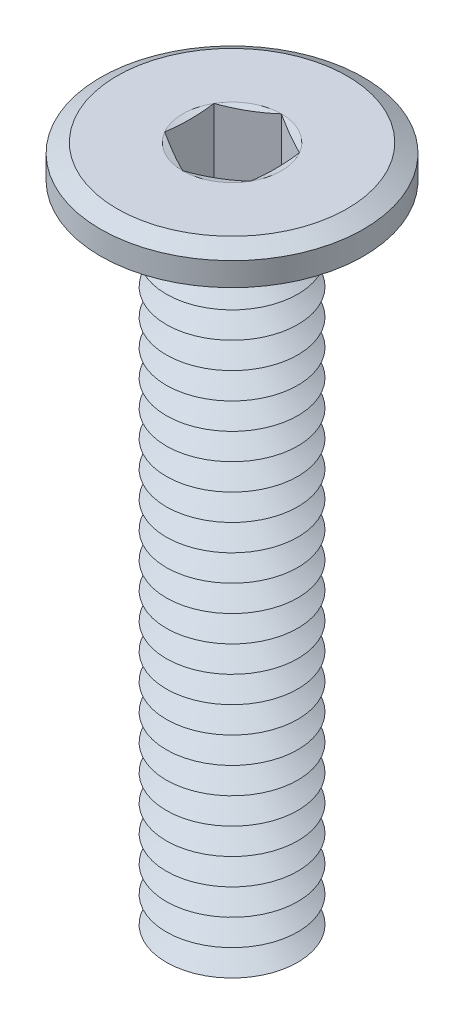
ISO-10303-21;
HEADER;
FILE_DESCRIPTION(('STEP AP214'),'2;1');
FILE_NAME('part.step','',(''),(''),'','','');
FILE_SCHEMA(('AUTOMOTIVE_DESIGN { 1 0 10303 214 1 1 1 1 }'));
ENDSEC;
DATA;
#1=APPLICATION_CONTEXT('core data for automotive mechanical design processes');
#2=APPLICATION_PROTOCOL_DEFINITION('international standard','automotive_design',2000,#1);
#3=PRODUCT_CONTEXT('',#1,'mechanical');
#4=PRODUCT('Part','Part','',(#3));
#5=PRODUCT_RELATED_PRODUCT_CATEGORY('part','',(#4));
#6=PRODUCT_DEFINITION_FORMATION('','',#4);
#7=PRODUCT_DEFINITION_CONTEXT('part definition',#1,'design');
#8=PRODUCT_DEFINITION('design','',#6,#7);
#9=PRODUCT_DEFINITION_SHAPE('','',#8);
#10=(LENGTH_UNIT() NAMED_UNIT(*) SI_UNIT(.MILLI.,.METRE.));
#11=(NAMED_UNIT(*) PLANE_ANGLE_UNIT() SI_UNIT($,.RADIAN.));
#12=(NAMED_UNIT(*) SI_UNIT($,.STERADIAN.) SOLID_ANGLE_UNIT());
#13=UNCERTAINTY_MEASURE_WITH_UNIT(LENGTH_MEASURE(1.E-05),#10,'distance_accuracy_value','');
#14=(GEOMETRIC_REPRESENTATION_CONTEXT(3) GLOBAL_UNCERTAINTY_ASSIGNED_CONTEXT((#13)) GLOBAL_UNIT_ASSIGNED_CONTEXT((#10,
#11,#12)) REPRESENTATION_CONTEXT('',''));
#15=CARTESIAN_POINT('',(0.,0.,0.));
#16=DIRECTION('',(0.,0.,1.));
#17=DIRECTION('',(1.,0.,0.));
#18=AXIS2_PLACEMENT_3D('',#15,#16,#17);
#19=CARTESIAN_POINT('',(0.,-9.9,0.));
#20=DIRECTION('',(0.,-1.,0.));
#21=DIRECTION('',(0.,0.,-1.));
#22=AXIS2_PLACEMENT_3D('',#19,#20,#21);
#23=CONICAL_SURFACE('',#22,1.,1.0471975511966);
#24=CARTESIAN_POINT('',(0.,-9.7,0.));
#25=DIRECTION('',(0.,1.,0.));
#26=DIRECTION('',(0.,0.,1.));
#27=AXIS2_PLACEMENT_3D('',#24,#25,#26);
#28=CIRCLE('',#27,0.653589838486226);
#29=CARTESIAN_POINT('',(0.,-9.7,0.653589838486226));
#30=VERTEX_POINT('',#29);
#31=EDGE_CURVE('E545',#30,#30,#28,.T.);
#32=ORIENTED_EDGE('',*,*,#31,.F.);
#33=EDGE_LOOP('',(#32));
#34=FACE_BOUND('',#33,.T.);
#35=CARTESIAN_POINT('',(0.,-9.9,0.));
#36=DIRECTION('',(0.,1.,0.));
#37=DIRECTION('',(0.,0.,1.));
#38=AXIS2_PLACEMENT_3D('',#35,#36,#37);
#39=CIRCLE('',#38,1.);
#40=CARTESIAN_POINT('',(0.,-9.9,1.));
#41=VERTEX_POINT('',#40);
#42=EDGE_CURVE('E548',#41,#41,#39,.T.);
#43=ORIENTED_EDGE('',*,*,#42,.T.);
#44=EDGE_LOOP('',(#43));
#45=FACE_BOUND('',#44,.T.);
#46=ADVANCED_FACE('F39',(#34,#45),#23,.T.);
#47=CARTESIAN_POINT('',(0.,-9.7,0.));
#48=DIRECTION('',(0.,1.,0.));
#49=DIRECTION('',(0.,0.,1.));
#50=AXIS2_PLACEMENT_3D('',#47,#48,#49);
#51=CONICAL_SURFACE('',#50,0.653589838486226,1.0471975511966);
#52=CARTESIAN_POINT('',(0.,-9.5,0.));
#53=DIRECTION('',(0.,1.,0.));
#54=DIRECTION('',(0.,0.,1.));
#55=AXIS2_PLACEMENT_3D('',#52,#53,#54);
#56=CIRCLE('',#55,1.);
#57=CARTESIAN_POINT('',(0.,-9.5,1.));
#58=VERTEX_POINT('',#57);
#59=EDGE_CURVE('E541',#58,#58,#56,.T.);
#60=ORIENTED_EDGE('',*,*,#59,.F.);
#61=EDGE_LOOP('',(#60));
#62=FACE_BOUND('',#61,.T.);
#63=ORIENTED_EDGE('',*,*,#31,.T.);
#64=EDGE_LOOP('',(#63));
#65=FACE_BOUND('',#64,.T.);
#66=ADVANCED_FACE('F232',(#62,#65),#51,.T.);
#67=CARTESIAN_POINT('',(0.,-10.5,0.));
#68=DIRECTION('',(0.,-1.,0.));
#69=DIRECTION('',(0.,0.,-1.));
#70=AXIS2_PLACEMENT_3D('',#67,#68,#69);
#71=PLANE('',#70);
#72=CARTESIAN_POINT('',(0.,-10.5,0.));
#73=DIRECTION('',(0.,1.,0.));
#74=DIRECTION('',(0.,0.,1.));
#75=AXIS2_PLACEMENT_3D('',#72,#73,#74);
#76=CIRCLE('',#75,0.653589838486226);
#77=CARTESIAN_POINT('',(0.,-10.5,0.653589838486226));
#78=VERTEX_POINT('',#77);
#79=EDGE_CURVE('E299',#78,#78,#76,.T.);
#80=ORIENTED_EDGE('',*,*,#79,.F.);
#81=EDGE_LOOP('',(#80));
#82=FACE_BOUND('',#81,.T.);
#83=ADVANCED_FACE('F238',(#82),#71,.T.);
#84=CARTESIAN_POINT('',(0.,-10.5,0.));
#85=DIRECTION('',(0.,1.,0.));
#86=DIRECTION('',(0.,0.,1.));
#87=AXIS2_PLACEMENT_3D('',#84,#85,#86);
#88=CONICAL_SURFACE('',#87,0.653589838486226,1.0471975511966);
#89=CARTESIAN_POINT('',(0.,-10.3,0.));
#90=DIRECTION('',(0.,1.,0.));
#91=DIRECTION('',(0.,0.,1.));
#92=AXIS2_PLACEMENT_3D('',#89,#90,#91);
#93=CIRCLE('',#92,1.);
#94=CARTESIAN_POINT('',(0.,-10.3,1.));
#95=VERTEX_POINT('',#94);
#96=EDGE_CURVE('E556',#95,#95,#93,.T.);
#97=ORIENTED_EDGE('',*,*,#96,.F.);
#98=EDGE_LOOP('',(#97));
#99=FACE_BOUND('',#98,.T.);
#100=ORIENTED_EDGE('',*,*,#79,.T.);
#101=EDGE_LOOP('',(#100));
#102=FACE_BOUND('',#101,.T.);
#103=ADVANCED_FACE('F253',(#99,#102),#88,.T.);
#104=CARTESIAN_POINT('',(0.,-10.3,0.));
#105=DIRECTION('',(0.,-1.,0.));
#106=DIRECTION('',(0.,0.,-1.));
#107=AXIS2_PLACEMENT_3D('',#104,#105,#106);
#108=CONICAL_SURFACE('',#107,1.,1.0471975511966);
#109=CARTESIAN_POINT('',(0.,-10.1,0.));
#110=DIRECTION('',(0.,1.,0.));
#111=DIRECTION('',(0.,0.,1.));
#112=AXIS2_PLACEMENT_3D('',#109,#110,#111);
#113=CIRCLE('',#112,0.653589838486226);
#114=CARTESIAN_POINT('',(0.,-10.1,0.653589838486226));
#115=VERTEX_POINT('',#114);
#116=EDGE_CURVE('E552',#115,#115,#113,.T.);
#117=ORIENTED_EDGE('',*,*,#116,.F.);
#118=EDGE_LOOP('',(#117));
#119=FACE_BOUND('',#118,.T.);
#120=ORIENTED_EDGE('',*,*,#96,.T.);
#121=EDGE_LOOP('',(#120));
#122=FACE_BOUND('',#121,.T.);
#123=ADVANCED_FACE('F249',(#119,#122),#108,.T.);
#124=CARTESIAN_POINT('',(0.,-10.1,0.));
#125=DIRECTION('',(0.,1.,0.));
#126=DIRECTION('',(0.,0.,1.));
#127=AXIS2_PLACEMENT_3D('',#124,#125,#126);
#128=CONICAL_SURFACE('',#127,0.653589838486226,1.0471975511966);
#129=ORIENTED_EDGE('',*,*,#42,.F.);
#130=EDGE_LOOP('',(#129));
#131=FACE_BOUND('',#130,.T.);
#132=ORIENTED_EDGE('',*,*,#116,.T.);
#133=EDGE_LOOP('',(#132));
#134=FACE_BOUND('',#133,.T.);
#135=ADVANCED_FACE('F245',(#131,#134),#128,.T.);
#136=CARTESIAN_POINT('',(0.,-9.5,0.));
#137=DIRECTION('',(0.,-1.,0.));
#138=DIRECTION('',(0.,0.,-1.));
#139=AXIS2_PLACEMENT_3D('',#136,#137,#138);
#140=CONICAL_SURFACE('',#139,1.,1.0471975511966);
#141=CARTESIAN_POINT('',(0.,-9.3,0.));
#142=DIRECTION('',(0.,1.,0.));
#143=DIRECTION('',(0.,0.,1.));
#144=AXIS2_PLACEMENT_3D('',#141,#142,#143);
#145=CIRCLE('',#144,0.653589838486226);
#146=CARTESIAN_POINT('',(0.,-9.3,0.653589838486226));
#147=VERTEX_POINT('',#146);
#148=EDGE_CURVE('E537',#147,#147,#145,.T.);
#149=ORIENTED_EDGE('',*,*,#148,.F.);
#150=EDGE_LOOP('',(#149));
#151=FACE_BOUND('',#150,.T.);
#152=ORIENTED_EDGE('',*,*,#59,.T.);
#153=EDGE_LOOP('',(#152));
#154=FACE_BOUND('',#153,.T.);
#155=ADVANCED_FACE('F248',(#151,#154),#140,.T.);
#156=CARTESIAN_POINT('',(0.,-9.3,0.));
#157=DIRECTION('',(0.,1.,0.));
#158=DIRECTION('',(0.,0.,1.));
#159=AXIS2_PLACEMENT_3D('',#156,#157,#158);
#160=CONICAL_SURFACE('',#159,0.653589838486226,1.0471975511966);
#161=CARTESIAN_POINT('',(0.,-9.1,0.));
#162=DIRECTION('',(0.,1.,0.));
#163=DIRECTION('',(0.,0.,1.));
#164=AXIS2_PLACEMENT_3D('',#161,#162,#163);
#165=CIRCLE('',#164,1.);
#166=CARTESIAN_POINT('',(0.,-9.1,1.));
#167=VERTEX_POINT('',#166);
#168=EDGE_CURVE('E533',#167,#167,#165,.T.);
#169=ORIENTED_EDGE('',*,*,#168,.F.);
#170=EDGE_LOOP('',(#169));
#171=FACE_BOUND('',#170,.T.);
#172=ORIENTED_EDGE('',*,*,#148,.T.);
#173=EDGE_LOOP('',(#172));
#174=FACE_BOUND('',#173,.T.);
#175=ADVANCED_FACE('F1019',(#171,#174),#160,.T.);
#176=CARTESIAN_POINT('',(0.,-9.1,0.));
#177=DIRECTION('',(0.,-1.,0.));
#178=DIRECTION('',(0.,0.,-1.));
#179=AXIS2_PLACEMENT_3D('',#176,#177,#178);
#180=CONICAL_SURFACE('',#179,1.,1.0471975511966);
#181=CARTESIAN_POINT('',(0.,-8.9,0.));
#182=DIRECTION('',(0.,1.,0.));
#183=DIRECTION('',(0.,0.,1.));
#184=AXIS2_PLACEMENT_3D('',#181,#182,#183);
#185=CIRCLE('',#184,0.653589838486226);
#186=CARTESIAN_POINT('',(0.,-8.9,0.653589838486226));
#187=VERTEX_POINT('',#186);
#188=EDGE_CURVE('E529',#187,#187,#185,.T.);
#189=ORIENTED_EDGE('',*,*,#188,.F.);
#190=EDGE_LOOP('',(#189));
#191=FACE_BOUND('',#190,.T.);
#192=ORIENTED_EDGE('',*,*,#168,.T.);
#193=EDGE_LOOP('',(#192));
#194=FACE_BOUND('',#193,.T.);
#195=ADVANCED_FACE('F1010',(#191,#194),#180,.T.);
#196=CARTESIAN_POINT('',(0.,-8.9,0.));
#197=DIRECTION('',(0.,1.,0.));
#198=DIRECTION('',(0.,0.,1.));
#199=AXIS2_PLACEMENT_3D('',#196,#197,#198);
#200=CONICAL_SURFACE('',#199,0.653589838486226,1.0471975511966);
#201=CARTESIAN_POINT('',(0.,-8.7,0.));
#202=DIRECTION('',(0.,1.,0.));
#203=DIRECTION('',(0.,0.,1.));
#204=AXIS2_PLACEMENT_3D('',#201,#202,#203);
#205=CIRCLE('',#204,1.);
#206=CARTESIAN_POINT('',(0.,-8.7,1.));
#207=VERTEX_POINT('',#206);
#208=EDGE_CURVE('E525',#207,#207,#205,.T.);
#209=ORIENTED_EDGE('',*,*,#208,.F.);
#210=EDGE_LOOP('',(#209));
#211=FACE_BOUND('',#210,.T.);
#212=ORIENTED_EDGE('',*,*,#188,.T.);
#213=EDGE_LOOP('',(#212));
#214=FACE_BOUND('',#213,.T.);
#215=ADVANCED_FACE('F1001',(#211,#214),#200,.T.);
#216=CARTESIAN_POINT('',(0.,-8.7,0.));
#217=DIRECTION('',(0.,-1.,0.));
#218=DIRECTION('',(0.,0.,-1.));
#219=AXIS2_PLACEMENT_3D('',#216,#217,#218);
#220=CONICAL_SURFACE('',#219,1.,1.0471975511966);
#221=CARTESIAN_POINT('',(0.,-8.5,0.));
#222=DIRECTION('',(0.,1.,0.));
#223=DIRECTION('',(0.,0.,1.));
#224=AXIS2_PLACEMENT_3D('',#221,#222,#223);
#225=CIRCLE('',#224,0.653589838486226);
#226=CARTESIAN_POINT('',(0.,-8.5,0.653589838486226));
#227=VERTEX_POINT('',#226);
#228=EDGE_CURVE('E521',#227,#227,#225,.T.);
#229=ORIENTED_EDGE('',*,*,#228,.F.);
#230=EDGE_LOOP('',(#229));
#231=FACE_BOUND('',#230,.T.);
#232=ORIENTED_EDGE('',*,*,#208,.T.);
#233=EDGE_LOOP('',(#232));
#234=FACE_BOUND('',#233,.T.);
#235=ADVANCED_FACE('F992',(#231,#234),#220,.T.);
#236=CARTESIAN_POINT('',(0.,-8.5,0.));
#237=DIRECTION('',(0.,1.,0.));
#238=DIRECTION('',(0.,0.,1.));
#239=AXIS2_PLACEMENT_3D('',#236,#237,#238);
#240=CONICAL_SURFACE('',#239,0.653589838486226,1.0471975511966);
#241=CARTESIAN_POINT('',(0.,-8.3,0.));
#242=DIRECTION('',(0.,1.,0.));
#243=DIRECTION('',(0.,0.,1.));
#244=AXIS2_PLACEMENT_3D('',#241,#242,#243);
#245=CIRCLE('',#244,1.);
#246=CARTESIAN_POINT('',(0.,-8.3,1.));
#247=VERTEX_POINT('',#246);
#248=EDGE_CURVE('E517',#247,#247,#245,.T.);
#249=ORIENTED_EDGE('',*,*,#248,.F.);
#250=EDGE_LOOP('',(#249));
#251=FACE_BOUND('',#250,.T.);
#252=ORIENTED_EDGE('',*,*,#228,.T.);
#253=EDGE_LOOP('',(#252));
#254=FACE_BOUND('',#253,.T.);
#255=ADVANCED_FACE('F983',(#251,#254),#240,.T.);
#256=CARTESIAN_POINT('',(0.,-8.3,0.));
#257=DIRECTION('',(0.,-1.,0.));
#258=DIRECTION('',(0.,0.,-1.));
#259=AXIS2_PLACEMENT_3D('',#256,#257,#258);
#260=CONICAL_SURFACE('',#259,1.,1.0471975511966);
#261=CARTESIAN_POINT('',(0.,-8.1,0.));
#262=DIRECTION('',(0.,1.,0.));
#263=DIRECTION('',(0.,0.,1.));
#264=AXIS2_PLACEMENT_3D('',#261,#262,#263);
#265=CIRCLE('',#264,0.653589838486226);
#266=CARTESIAN_POINT('',(0.,-8.1,0.653589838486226));
#267=VERTEX_POINT('',#266);
#268=EDGE_CURVE('E513',#267,#267,#265,.T.);
#269=ORIENTED_EDGE('',*,*,#268,.F.);
#270=EDGE_LOOP('',(#269));
#271=FACE_BOUND('',#270,.T.);
#272=ORIENTED_EDGE('',*,*,#248,.T.);
#273=EDGE_LOOP('',(#272));
#274=FACE_BOUND('',#273,.T.);
#275=ADVANCED_FACE('F974',(#271,#274),#260,.T.);
#276=CARTESIAN_POINT('',(0.,-8.1,0.));
#277=DIRECTION('',(0.,1.,0.));
#278=DIRECTION('',(0.,0.,1.));
#279=AXIS2_PLACEMENT_3D('',#276,#277,#278);
#280=CONICAL_SURFACE('',#279,0.653589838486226,1.0471975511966);
#281=CARTESIAN_POINT('',(0.,-7.9,0.));
#282=DIRECTION('',(0.,1.,0.));
#283=DIRECTION('',(0.,0.,1.));
#284=AXIS2_PLACEMENT_3D('',#281,#282,#283);
#285=CIRCLE('',#284,1.);
#286=CARTESIAN_POINT('',(0.,-7.9,1.));
#287=VERTEX_POINT('',#286);
#288=EDGE_CURVE('E509',#287,#287,#285,.T.);
#289=ORIENTED_EDGE('',*,*,#288,.F.);
#290=EDGE_LOOP('',(#289));
#291=FACE_BOUND('',#290,.T.);
#292=ORIENTED_EDGE('',*,*,#268,.T.);
#293=EDGE_LOOP('',(#292));
#294=FACE_BOUND('',#293,.T.);
#295=ADVANCED_FACE('F965',(#291,#294),#280,.T.);
#296=CARTESIAN_POINT('',(0.,-7.9,0.));
#297=DIRECTION('',(0.,-1.,0.));
#298=DIRECTION('',(0.,0.,-1.));
#299=AXIS2_PLACEMENT_3D('',#296,#297,#298);
#300=CONICAL_SURFACE('',#299,1.,1.0471975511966);
#301=CARTESIAN_POINT('',(0.,-7.7,0.));
#302=DIRECTION('',(0.,1.,0.));
#303=DIRECTION('',(0.,0.,1.));
#304=AXIS2_PLACEMENT_3D('',#301,#302,#303);
#305=CIRCLE('',#304,0.653589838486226);
#306=CARTESIAN_POINT('',(0.,-7.7,0.653589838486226));
#307=VERTEX_POINT('',#306);
#308=EDGE_CURVE('E505',#307,#307,#305,.T.);
#309=ORIENTED_EDGE('',*,*,#308,.F.);
#310=EDGE_LOOP('',(#309));
#311=FACE_BOUND('',#310,.T.);
#312=ORIENTED_EDGE('',*,*,#288,.T.);
#313=EDGE_LOOP('',(#312));
#314=FACE_BOUND('',#313,.T.);
#315=ADVANCED_FACE('F956',(#311,#314),#300,.T.);
#316=CARTESIAN_POINT('',(0.,-7.7,0.));
#317=DIRECTION('',(0.,1.,0.));
#318=DIRECTION('',(0.,0.,1.));
#319=AXIS2_PLACEMENT_3D('',#316,#317,#318);
#320=CONICAL_SURFACE('',#319,0.653589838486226,1.0471975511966);
#321=CARTESIAN_POINT('',(0.,-7.5,0.));
#322=DIRECTION('',(0.,1.,0.));
#323=DIRECTION('',(0.,0.,1.));
#324=AXIS2_PLACEMENT_3D('',#321,#322,#323);
#325=CIRCLE('',#324,1.);
#326=CARTESIAN_POINT('',(0.,-7.5,1.));
#327=VERTEX_POINT('',#326);
#328=EDGE_CURVE('E501',#327,#327,#325,.T.);
#329=ORIENTED_EDGE('',*,*,#328,.F.);
#330=EDGE_LOOP('',(#329));
#331=FACE_BOUND('',#330,.T.);
#332=ORIENTED_EDGE('',*,*,#308,.T.);
#333=EDGE_LOOP('',(#332));
#334=FACE_BOUND('',#333,.T.);
#335=ADVANCED_FACE('F947',(#331,#334),#320,.T.);
#336=CARTESIAN_POINT('',(0.,-7.5,0.));
#337=DIRECTION('',(0.,-1.,0.));
#338=DIRECTION('',(0.,0.,-1.));
#339=AXIS2_PLACEMENT_3D('',#336,#337,#338);
#340=CONICAL_SURFACE('',#339,1.,1.0471975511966);
#341=CARTESIAN_POINT('',(0.,-7.3,0.));
#342=DIRECTION('',(0.,1.,0.));
#343=DIRECTION('',(0.,0.,1.));
#344=AXIS2_PLACEMENT_3D('',#341,#342,#343);
#345=CIRCLE('',#344,0.653589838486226);
#346=CARTESIAN_POINT('',(0.,-7.3,0.653589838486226));
#347=VERTEX_POINT('',#346);
#348=EDGE_CURVE('E497',#347,#347,#345,.T.);
#349=ORIENTED_EDGE('',*,*,#348,.F.);
#350=EDGE_LOOP('',(#349));
#351=FACE_BOUND('',#350,.T.);
#352=ORIENTED_EDGE('',*,*,#328,.T.);
#353=EDGE_LOOP('',(#352));
#354=FACE_BOUND('',#353,.T.);
#355=ADVANCED_FACE('F938',(#351,#354),#340,.T.);
#356=CARTESIAN_POINT('',(0.,-7.3,0.));
#357=DIRECTION('',(0.,1.,0.));
#358=DIRECTION('',(0.,0.,1.));
#359=AXIS2_PLACEMENT_3D('',#356,#357,#358);
#360=CONICAL_SURFACE('',#359,0.653589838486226,1.0471975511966);
#361=CARTESIAN_POINT('',(0.,-7.1,0.));
#362=DIRECTION('',(0.,1.,0.));
#363=DIRECTION('',(0.,0.,1.));
#364=AXIS2_PLACEMENT_3D('',#361,#362,#363);
#365=CIRCLE('',#364,1.);
#366=CARTESIAN_POINT('',(0.,-7.1,1.));
#367=VERTEX_POINT('',#366);
#368=EDGE_CURVE('E493',#367,#367,#365,.T.);
#369=ORIENTED_EDGE('',*,*,#368,.F.);
#370=EDGE_LOOP('',(#369));
#371=FACE_BOUND('',#370,.T.);
#372=ORIENTED_EDGE('',*,*,#348,.T.);
#373=EDGE_LOOP('',(#372));
#374=FACE_BOUND('',#373,.T.);
#375=ADVANCED_FACE('F929',(#371,#374),#360,.T.);
#376=CARTESIAN_POINT('',(0.,-7.1,0.));
#377=DIRECTION('',(0.,-1.,0.));
#378=DIRECTION('',(0.,0.,-1.));
#379=AXIS2_PLACEMENT_3D('',#376,#377,#378);
#380=CONICAL_SURFACE('',#379,1.,1.0471975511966);
#381=CARTESIAN_POINT('',(0.,-6.9,0.));
#382=DIRECTION('',(0.,1.,0.));
#383=DIRECTION('',(0.,0.,1.));
#384=AXIS2_PLACEMENT_3D('',#381,#382,#383);
#385=CIRCLE('',#384,0.653589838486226);
#386=CARTESIAN_POINT('',(0.,-6.9,0.653589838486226));
#387=VERTEX_POINT('',#386);
#388=EDGE_CURVE('E490',#387,#387,#385,.T.);
#389=ORIENTED_EDGE('',*,*,#388,.F.);
#390=EDGE_LOOP('',(#389));
#391=FACE_BOUND('',#390,.T.);
#392=ORIENTED_EDGE('',*,*,#368,.T.);
#393=EDGE_LOOP('',(#392));
#394=FACE_BOUND('',#393,.T.);
#395=ADVANCED_FACE('F920',(#391,#394),#380,.T.);
#396=CARTESIAN_POINT('',(0.,-6.9,0.));
#397=DIRECTION('',(0.,1.,0.));
#398=DIRECTION('',(0.,0.,1.));
#399=AXIS2_PLACEMENT_3D('',#396,#397,#398);
#400=CONICAL_SURFACE('',#399,0.653589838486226,1.0471975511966);
#401=CARTESIAN_POINT('',(0.,-6.7,0.));
#402=DIRECTION('',(0.,1.,0.));
#403=DIRECTION('',(0.,0.,1.));
#404=AXIS2_PLACEMENT_3D('',#401,#402,#403);
#405=CIRCLE('',#404,1.);
#406=CARTESIAN_POINT('',(0.,-6.7,1.));
#407=VERTEX_POINT('',#406);
#408=EDGE_CURVE('E486',#407,#407,#405,.T.);
#409=ORIENTED_EDGE('',*,*,#408,.F.);
#410=EDGE_LOOP('',(#409));
#411=FACE_BOUND('',#410,.T.);
#412=ORIENTED_EDGE('',*,*,#388,.T.);
#413=EDGE_LOOP('',(#412));
#414=FACE_BOUND('',#413,.T.);
#415=ADVANCED_FACE('F911',(#411,#414),#400,.T.);
#416=CARTESIAN_POINT('',(0.,-6.7,0.));
#417=DIRECTION('',(0.,-1.,0.));
#418=DIRECTION('',(0.,0.,-1.));
#419=AXIS2_PLACEMENT_3D('',#416,#417,#418);
#420=CONICAL_SURFACE('',#419,1.,1.0471975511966);
#421=CARTESIAN_POINT('',(0.,-6.5,0.));
#422=DIRECTION('',(0.,1.,0.));
#423=DIRECTION('',(0.,0.,1.));
#424=AXIS2_PLACEMENT_3D('',#421,#422,#423);
#425=CIRCLE('',#424,0.653589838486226);
#426=CARTESIAN_POINT('',(0.,-6.5,0.653589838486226));
#427=VERTEX_POINT('',#426);
#428=EDGE_CURVE('E482',#427,#427,#425,.T.);
#429=ORIENTED_EDGE('',*,*,#428,.F.);
#430=EDGE_LOOP('',(#429));
#431=FACE_BOUND('',#430,.T.);
#432=ORIENTED_EDGE('',*,*,#408,.T.);
#433=EDGE_LOOP('',(#432));
#434=FACE_BOUND('',#433,.T.);
#435=ADVANCED_FACE('F902',(#431,#434),#420,.T.);
#436=CARTESIAN_POINT('',(0.,-6.5,0.));
#437=DIRECTION('',(0.,1.,0.));
#438=DIRECTION('',(0.,0.,1.));
#439=AXIS2_PLACEMENT_3D('',#436,#437,#438);
#440=CONICAL_SURFACE('',#439,0.653589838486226,1.0471975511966);
#441=CARTESIAN_POINT('',(0.,-6.3,0.));
#442=DIRECTION('',(0.,1.,0.));
#443=DIRECTION('',(0.,0.,1.));
#444=AXIS2_PLACEMENT_3D('',#441,#442,#443);
#445=CIRCLE('',#444,1.);
#446=CARTESIAN_POINT('',(0.,-6.3,1.));
#447=VERTEX_POINT('',#446);
#448=EDGE_CURVE('E478',#447,#447,#445,.T.);
#449=ORIENTED_EDGE('',*,*,#448,.F.);
#450=EDGE_LOOP('',(#449));
#451=FACE_BOUND('',#450,.T.);
#452=ORIENTED_EDGE('',*,*,#428,.T.);
#453=EDGE_LOOP('',(#452));
#454=FACE_BOUND('',#453,.T.);
#455=ADVANCED_FACE('F893',(#451,#454),#440,.T.);
#456=CARTESIAN_POINT('',(0.,-6.3,0.));
#457=DIRECTION('',(0.,-1.,0.));
#458=DIRECTION('',(0.,0.,-1.));
#459=AXIS2_PLACEMENT_3D('',#456,#457,#458);
#460=CONICAL_SURFACE('',#459,1.,1.0471975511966);
#461=CARTESIAN_POINT('',(0.,-6.1,0.));
#462=DIRECTION('',(0.,1.,0.));
#463=DIRECTION('',(0.,0.,1.));
#464=AXIS2_PLACEMENT_3D('',#461,#462,#463);
#465=CIRCLE('',#464,0.653589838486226);
#466=CARTESIAN_POINT('',(0.,-6.1,0.653589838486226));
#467=VERTEX_POINT('',#466);
#468=EDGE_CURVE('E474',#467,#467,#465,.T.);
#469=ORIENTED_EDGE('',*,*,#468,.F.);
#470=EDGE_LOOP('',(#469));
#471=FACE_BOUND('',#470,.T.);
#472=ORIENTED_EDGE('',*,*,#448,.T.);
#473=EDGE_LOOP('',(#472));
#474=FACE_BOUND('',#473,.T.);
#475=ADVANCED_FACE('F884',(#471,#474),#460,.T.);
#476=CARTESIAN_POINT('',(0.,-6.1,0.));
#477=DIRECTION('',(0.,1.,0.));
#478=DIRECTION('',(0.,0.,1.));
#479=AXIS2_PLACEMENT_3D('',#476,#477,#478);
#480=CONICAL_SURFACE('',#479,0.653589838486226,1.0471975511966);
#481=CARTESIAN_POINT('',(0.,-5.9,0.));
#482=DIRECTION('',(0.,1.,0.));
#483=DIRECTION('',(0.,0.,1.));
#484=AXIS2_PLACEMENT_3D('',#481,#482,#483);
#485=CIRCLE('',#484,1.);
#486=CARTESIAN_POINT('',(0.,-5.9,1.));
#487=VERTEX_POINT('',#486);
#488=EDGE_CURVE('E470',#487,#487,#485,.T.);
#489=ORIENTED_EDGE('',*,*,#488,.F.);
#490=EDGE_LOOP('',(#489));
#491=FACE_BOUND('',#490,.T.);
#492=ORIENTED_EDGE('',*,*,#468,.T.);
#493=EDGE_LOOP('',(#492));
#494=FACE_BOUND('',#493,.T.);
#495=ADVANCED_FACE('F875',(#491,#494),#480,.T.);
#496=CARTESIAN_POINT('',(0.,-5.9,0.));
#497=DIRECTION('',(0.,-1.,0.));
#498=DIRECTION('',(0.,0.,-1.));
#499=AXIS2_PLACEMENT_3D('',#496,#497,#498);
#500=CONICAL_SURFACE('',#499,1.,1.0471975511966);
#501=CARTESIAN_POINT('',(0.,-5.7,0.));
#502=DIRECTION('',(0.,1.,0.));
#503=DIRECTION('',(0.,0.,1.));
#504=AXIS2_PLACEMENT_3D('',#501,#502,#503);
#505=CIRCLE('',#504,0.653589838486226);
#506=CARTESIAN_POINT('',(0.,-5.7,0.653589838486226));
#507=VERTEX_POINT('',#506);
#508=EDGE_CURVE('E466',#507,#507,#505,.T.);
#509=ORIENTED_EDGE('',*,*,#508,.F.);
#510=EDGE_LOOP('',(#509));
#511=FACE_BOUND('',#510,.T.);
#512=ORIENTED_EDGE('',*,*,#488,.T.);
#513=EDGE_LOOP('',(#512));
#514=FACE_BOUND('',#513,.T.);
#515=ADVANCED_FACE('F866',(#511,#514),#500,.T.);
#516=CARTESIAN_POINT('',(0.,-5.7,0.));
#517=DIRECTION('',(0.,1.,0.));
#518=DIRECTION('',(0.,0.,1.));
#519=AXIS2_PLACEMENT_3D('',#516,#517,#518);
#520=CONICAL_SURFACE('',#519,0.653589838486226,1.0471975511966);
#521=CARTESIAN_POINT('',(0.,-5.5,0.));
#522=DIRECTION('',(0.,1.,0.));
#523=DIRECTION('',(0.,0.,1.));
#524=AXIS2_PLACEMENT_3D('',#521,#522,#523);
#525=CIRCLE('',#524,1.);
#526=CARTESIAN_POINT('',(0.,-5.5,1.));
#527=VERTEX_POINT('',#526);
#528=EDGE_CURVE('E463',#527,#527,#525,.T.);
#529=ORIENTED_EDGE('',*,*,#528,.F.);
#530=EDGE_LOOP('',(#529));
#531=FACE_BOUND('',#530,.T.);
#532=ORIENTED_EDGE('',*,*,#508,.T.);
#533=EDGE_LOOP('',(#532));
#534=FACE_BOUND('',#533,.T.);
#535=ADVANCED_FACE('F857',(#531,#534),#520,.T.);
#536=CARTESIAN_POINT('',(0.,-5.5,0.));
#537=DIRECTION('',(0.,-1.,0.));
#538=DIRECTION('',(0.,0.,-1.));
#539=AXIS2_PLACEMENT_3D('',#536,#537,#538);
#540=CONICAL_SURFACE('',#539,1.,1.0471975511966);
#541=CARTESIAN_POINT('',(0.,-5.3,0.));
#542=DIRECTION('',(0.,1.,0.));
#543=DIRECTION('',(0.,0.,1.));
#544=AXIS2_PLACEMENT_3D('',#541,#542,#543);
#545=CIRCLE('',#544,0.653589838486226);
#546=CARTESIAN_POINT('',(0.,-5.3,0.653589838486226));
#547=VERTEX_POINT('',#546);
#548=EDGE_CURVE('E459',#547,#547,#545,.T.);
#549=ORIENTED_EDGE('',*,*,#548,.F.);
#550=EDGE_LOOP('',(#549));
#551=FACE_BOUND('',#550,.T.);
#552=ORIENTED_EDGE('',*,*,#528,.T.);
#553=EDGE_LOOP('',(#552));
#554=FACE_BOUND('',#553,.T.);
#555=ADVANCED_FACE('F848',(#551,#554),#540,.T.);
#556=CARTESIAN_POINT('',(0.,-5.3,0.));
#557=DIRECTION('',(0.,1.,0.));
#558=DIRECTION('',(0.,0.,1.));
#559=AXIS2_PLACEMENT_3D('',#556,#557,#558);
#560=CONICAL_SURFACE('',#559,0.653589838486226,1.0471975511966);
#561=CARTESIAN_POINT('',(0.,-5.1,0.));
#562=DIRECTION('',(0.,1.,0.));
#563=DIRECTION('',(0.,0.,1.));
#564=AXIS2_PLACEMENT_3D('',#561,#562,#563);
#565=CIRCLE('',#564,1.);
#566=CARTESIAN_POINT('',(0.,-5.1,1.));
#567=VERTEX_POINT('',#566);
#568=EDGE_CURVE('E456',#567,#567,#565,.T.);
#569=ORIENTED_EDGE('',*,*,#568,.F.);
#570=EDGE_LOOP('',(#569));
#571=FACE_BOUND('',#570,.T.);
#572=ORIENTED_EDGE('',*,*,#548,.T.);
#573=EDGE_LOOP('',(#572));
#574=FACE_BOUND('',#573,.T.);
#575=ADVANCED_FACE('F839',(#571,#574),#560,.T.);
#576=CARTESIAN_POINT('',(0.,-5.1,0.));
#577=DIRECTION('',(0.,-1.,0.));
#578=DIRECTION('',(0.,0.,-1.));
#579=AXIS2_PLACEMENT_3D('',#576,#577,#578);
#580=CONICAL_SURFACE('',#579,1.,1.0471975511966);
#581=CARTESIAN_POINT('',(0.,-4.9,0.));
#582=DIRECTION('',(0.,1.,0.));
#583=DIRECTION('',(0.,0.,1.));
#584=AXIS2_PLACEMENT_3D('',#581,#582,#583);
#585=CIRCLE('',#584,0.653589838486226);
#586=CARTESIAN_POINT('',(0.,-4.9,0.653589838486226));
#587=VERTEX_POINT('',#586);
#588=EDGE_CURVE('E452',#587,#587,#585,.T.);
#589=ORIENTED_EDGE('',*,*,#588,.F.);
#590=EDGE_LOOP('',(#589));
#591=FACE_BOUND('',#590,.T.);
#592=ORIENTED_EDGE('',*,*,#568,.T.);
#593=EDGE_LOOP('',(#592));
#594=FACE_BOUND('',#593,.T.);
#595=ADVANCED_FACE('F830',(#591,#594),#580,.T.);
#596=CARTESIAN_POINT('',(0.,-4.9,0.));
#597=DIRECTION('',(0.,1.,0.));
#598=DIRECTION('',(0.,0.,1.));
#599=AXIS2_PLACEMENT_3D('',#596,#597,#598);
#600=CONICAL_SURFACE('',#599,0.653589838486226,1.0471975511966);
#601=CARTESIAN_POINT('',(0.,-4.7,0.));
#602=DIRECTION('',(0.,1.,0.));
#603=DIRECTION('',(0.,0.,1.));
#604=AXIS2_PLACEMENT_3D('',#601,#602,#603);
#605=CIRCLE('',#604,1.);
#606=CARTESIAN_POINT('',(0.,-4.7,1.));
#607=VERTEX_POINT('',#606);
#608=EDGE_CURVE('E448',#607,#607,#605,.T.);
#609=ORIENTED_EDGE('',*,*,#608,.F.);
#610=EDGE_LOOP('',(#609));
#611=FACE_BOUND('',#610,.T.);
#612=ORIENTED_EDGE('',*,*,#588,.T.);
#613=EDGE_LOOP('',(#612));
#614=FACE_BOUND('',#613,.T.);
#615=ADVANCED_FACE('F821',(#611,#614),#600,.T.);
#616=CARTESIAN_POINT('',(0.,-4.7,0.));
#617=DIRECTION('',(0.,-1.,0.));
#618=DIRECTION('',(0.,0.,-1.));
#619=AXIS2_PLACEMENT_3D('',#616,#617,#618);
#620=CONICAL_SURFACE('',#619,1.,1.0471975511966);
#621=CARTESIAN_POINT('',(0.,-4.5,0.));
#622=DIRECTION('',(0.,1.,0.));
#623=DIRECTION('',(0.,0.,1.));
#624=AXIS2_PLACEMENT_3D('',#621,#622,#623);
#625=CIRCLE('',#624,0.653589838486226);
#626=CARTESIAN_POINT('',(0.,-4.5,0.653589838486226));
#627=VERTEX_POINT('',#626);
#628=EDGE_CURVE('E444',#627,#627,#625,.T.);
#629=ORIENTED_EDGE('',*,*,#628,.F.);
#630=EDGE_LOOP('',(#629));
#631=FACE_BOUND('',#630,.T.);
#632=ORIENTED_EDGE('',*,*,#608,.T.);
#633=EDGE_LOOP('',(#632));
#634=FACE_BOUND('',#633,.T.);
#635=ADVANCED_FACE('F812',(#631,#634),#620,.T.);
#636=CARTESIAN_POINT('',(0.,-4.5,0.));
#637=DIRECTION('',(0.,1.,0.));
#638=DIRECTION('',(0.,0.,1.));
#639=AXIS2_PLACEMENT_3D('',#636,#637,#638);
#640=CONICAL_SURFACE('',#639,0.653589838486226,1.0471975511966);
#641=CARTESIAN_POINT('',(0.,-4.3,0.));
#642=DIRECTION('',(0.,1.,0.));
#643=DIRECTION('',(0.,0.,1.));
#644=AXIS2_PLACEMENT_3D('',#641,#642,#643);
#645=CIRCLE('',#644,1.);
#646=CARTESIAN_POINT('',(0.,-4.3,1.));
#647=VERTEX_POINT('',#646);
#648=EDGE_CURVE('E440',#647,#647,#645,.T.);
#649=ORIENTED_EDGE('',*,*,#648,.F.);
#650=EDGE_LOOP('',(#649));
#651=FACE_BOUND('',#650,.T.);
#652=ORIENTED_EDGE('',*,*,#628,.T.);
#653=EDGE_LOOP('',(#652));
#654=FACE_BOUND('',#653,.T.);
#655=ADVANCED_FACE('F803',(#651,#654),#640,.T.);
#656=CARTESIAN_POINT('',(0.,-4.3,0.));
#657=DIRECTION('',(0.,-1.,0.));
#658=DIRECTION('',(0.,0.,-1.));
#659=AXIS2_PLACEMENT_3D('',#656,#657,#658);
#660=CONICAL_SURFACE('',#659,1.,1.0471975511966);
#661=CARTESIAN_POINT('',(0.,-4.1,0.));
#662=DIRECTION('',(0.,1.,0.));
#663=DIRECTION('',(0.,0.,1.));
#664=AXIS2_PLACEMENT_3D('',#661,#662,#663);
#665=CIRCLE('',#664,0.653589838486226);
#666=CARTESIAN_POINT('',(0.,-4.1,0.653589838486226));
#667=VERTEX_POINT('',#666);
#668=EDGE_CURVE('E436',#667,#667,#665,.T.);
#669=ORIENTED_EDGE('',*,*,#668,.F.);
#670=EDGE_LOOP('',(#669));
#671=FACE_BOUND('',#670,.T.);
#672=ORIENTED_EDGE('',*,*,#648,.T.);
#673=EDGE_LOOP('',(#672));
#674=FACE_BOUND('',#673,.T.);
#675=ADVANCED_FACE('F794',(#671,#674),#660,.T.);
#676=CARTESIAN_POINT('',(0.,-4.1,0.));
#677=DIRECTION('',(0.,1.,0.));
#678=DIRECTION('',(0.,0.,1.));
#679=AXIS2_PLACEMENT_3D('',#676,#677,#678);
#680=CONICAL_SURFACE('',#679,0.653589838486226,1.0471975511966);
#681=CARTESIAN_POINT('',(0.,-3.9,0.));
#682=DIRECTION('',(0.,1.,0.));
#683=DIRECTION('',(0.,0.,1.));
#684=AXIS2_PLACEMENT_3D('',#681,#682,#683);
#685=CIRCLE('',#684,1.);
#686=CARTESIAN_POINT('',(0.,-3.9,1.));
#687=VERTEX_POINT('',#686);
#688=EDGE_CURVE('E432',#687,#687,#685,.T.);
#689=ORIENTED_EDGE('',*,*,#688,.F.);
#690=EDGE_LOOP('',(#689));
#691=FACE_BOUND('',#690,.T.);
#692=ORIENTED_EDGE('',*,*,#668,.T.);
#693=EDGE_LOOP('',(#692));
#694=FACE_BOUND('',#693,.T.);
#695=ADVANCED_FACE('F785',(#691,#694),#680,.T.);
#696=CARTESIAN_POINT('',(0.,-3.9,0.));
#697=DIRECTION('',(0.,-1.,0.));
#698=DIRECTION('',(0.,0.,-1.));
#699=AXIS2_PLACEMENT_3D('',#696,#697,#698);
#700=CONICAL_SURFACE('',#699,1.,1.0471975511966);
#701=CARTESIAN_POINT('',(0.,-3.7,0.));
#702=DIRECTION('',(0.,1.,0.));
#703=DIRECTION('',(0.,0.,1.));
#704=AXIS2_PLACEMENT_3D('',#701,#702,#703);
#705=CIRCLE('',#704,0.653589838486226);
#706=CARTESIAN_POINT('',(0.,-3.7,0.653589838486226));
#707=VERTEX_POINT('',#706);
#708=EDGE_CURVE('E428',#707,#707,#705,.T.);
#709=ORIENTED_EDGE('',*,*,#708,.F.);
#710=EDGE_LOOP('',(#709));
#711=FACE_BOUND('',#710,.T.);
#712=ORIENTED_EDGE('',*,*,#688,.T.);
#713=EDGE_LOOP('',(#712));
#714=FACE_BOUND('',#713,.T.);
#715=ADVANCED_FACE('F776',(#711,#714),#700,.T.);
#716=CARTESIAN_POINT('',(0.,-3.7,0.));
#717=DIRECTION('',(0.,1.,0.));
#718=DIRECTION('',(0.,0.,1.));
#719=AXIS2_PLACEMENT_3D('',#716,#717,#718);
#720=CONICAL_SURFACE('',#719,0.653589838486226,1.0471975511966);
#721=CARTESIAN_POINT('',(0.,-3.5,0.));
#722=DIRECTION('',(0.,1.,0.));
#723=DIRECTION('',(0.,0.,1.));
#724=AXIS2_PLACEMENT_3D('',#721,#722,#723);
#725=CIRCLE('',#724,1.);
#726=CARTESIAN_POINT('',(0.,-3.5,1.));
#727=VERTEX_POINT('',#726);
#728=EDGE_CURVE('E424',#727,#727,#725,.T.);
#729=ORIENTED_EDGE('',*,*,#728,.F.);
#730=EDGE_LOOP('',(#729));
#731=FACE_BOUND('',#730,.T.);
#732=ORIENTED_EDGE('',*,*,#708,.T.);
#733=EDGE_LOOP('',(#732));
#734=FACE_BOUND('',#733,.T.);
#735=ADVANCED_FACE('F767',(#731,#734),#720,.T.);
#736=CARTESIAN_POINT('',(0.,-3.5,0.));
#737=DIRECTION('',(0.,-1.,0.));
#738=DIRECTION('',(0.,0.,-1.));
#739=AXIS2_PLACEMENT_3D('',#736,#737,#738);
#740=CONICAL_SURFACE('',#739,1.,1.0471975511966);
#741=CARTESIAN_POINT('',(0.,-3.3,0.));
#742=DIRECTION('',(0.,1.,0.));
#743=DIRECTION('',(0.,0.,1.));
#744=AXIS2_PLACEMENT_3D('',#741,#742,#743);
#745=CIRCLE('',#744,0.653589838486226);
#746=CARTESIAN_POINT('',(0.,-3.3,0.653589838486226));
#747=VERTEX_POINT('',#746);
#748=EDGE_CURVE('E420',#747,#747,#745,.T.);
#749=ORIENTED_EDGE('',*,*,#748,.F.);
#750=EDGE_LOOP('',(#749));
#751=FACE_BOUND('',#750,.T.);
#752=ORIENTED_EDGE('',*,*,#728,.T.);
#753=EDGE_LOOP('',(#752));
#754=FACE_BOUND('',#753,.T.);
#755=ADVANCED_FACE('F758',(#751,#754),#740,.T.);
#756=CARTESIAN_POINT('',(0.,-3.3,0.));
#757=DIRECTION('',(0.,1.,0.));
#758=DIRECTION('',(0.,0.,1.));
#759=AXIS2_PLACEMENT_3D('',#756,#757,#758);
#760=CONICAL_SURFACE('',#759,0.653589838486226,1.0471975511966);
#761=CARTESIAN_POINT('',(0.,-3.1,0.));
#762=DIRECTION('',(0.,1.,0.));
#763=DIRECTION('',(0.,0.,1.));
#764=AXIS2_PLACEMENT_3D('',#761,#762,#763);
#765=CIRCLE('',#764,1.);
#766=CARTESIAN_POINT('',(0.,-3.1,1.));
#767=VERTEX_POINT('',#766);
#768=EDGE_CURVE('E416',#767,#767,#765,.T.);
#769=ORIENTED_EDGE('',*,*,#768,.F.);
#770=EDGE_LOOP('',(#769));
#771=FACE_BOUND('',#770,.T.);
#772=ORIENTED_EDGE('',*,*,#748,.T.);
#773=EDGE_LOOP('',(#772));
#774=FACE_BOUND('',#773,.T.);
#775=ADVANCED_FACE('F749',(#771,#774),#760,.T.);
#776=CARTESIAN_POINT('',(0.,-3.1,0.));
#777=DIRECTION('',(0.,-1.,0.));
#778=DIRECTION('',(0.,0.,-1.));
#779=AXIS2_PLACEMENT_3D('',#776,#777,#778);
#780=CONICAL_SURFACE('',#779,1.,1.0471975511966);
#781=CARTESIAN_POINT('',(0.,-2.9,0.));
#782=DIRECTION('',(0.,1.,0.));
#783=DIRECTION('',(0.,0.,1.));
#784=AXIS2_PLACEMENT_3D('',#781,#782,#783);
#785=CIRCLE('',#784,0.653589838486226);
#786=CARTESIAN_POINT('',(0.,-2.9,0.653589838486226));
#787=VERTEX_POINT('',#786);
#788=EDGE_CURVE('E412',#787,#787,#785,.T.);
#789=ORIENTED_EDGE('',*,*,#788,.F.);
#790=EDGE_LOOP('',(#789));
#791=FACE_BOUND('',#790,.T.);
#792=ORIENTED_EDGE('',*,*,#768,.T.);
#793=EDGE_LOOP('',(#792));
#794=FACE_BOUND('',#793,.T.);
#795=ADVANCED_FACE('F740',(#791,#794),#780,.T.);
#796=CARTESIAN_POINT('',(0.,-2.9,0.));
#797=DIRECTION('',(0.,1.,0.));
#798=DIRECTION('',(0.,0.,1.));
#799=AXIS2_PLACEMENT_3D('',#796,#797,#798);
#800=CONICAL_SURFACE('',#799,0.653589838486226,1.0471975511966);
#801=CARTESIAN_POINT('',(0.,-2.7,0.));
#802=DIRECTION('',(0.,1.,0.));
#803=DIRECTION('',(0.,0.,1.));
#804=AXIS2_PLACEMENT_3D('',#801,#802,#803);
#805=CIRCLE('',#804,1.);
#806=CARTESIAN_POINT('',(0.,-2.7,1.));
#807=VERTEX_POINT('',#806);
#808=EDGE_CURVE('E408',#807,#807,#805,.T.);
#809=ORIENTED_EDGE('',*,*,#808,.F.);
#810=EDGE_LOOP('',(#809));
#811=FACE_BOUND('',#810,.T.);
#812=ORIENTED_EDGE('',*,*,#788,.T.);
#813=EDGE_LOOP('',(#812));
#814=FACE_BOUND('',#813,.T.);
#815=ADVANCED_FACE('F731',(#811,#814),#800,.T.);
#816=CARTESIAN_POINT('',(0.,-2.7,0.));
#817=DIRECTION('',(0.,-1.,0.));
#818=DIRECTION('',(0.,0.,-1.));
#819=AXIS2_PLACEMENT_3D('',#816,#817,#818);
#820=CONICAL_SURFACE('',#819,1.,1.0471975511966);
#821=CARTESIAN_POINT('',(0.,-2.5,0.));
#822=DIRECTION('',(0.,1.,0.));
#823=DIRECTION('',(0.,0.,1.));
#824=AXIS2_PLACEMENT_3D('',#821,#822,#823);
#825=CIRCLE('',#824,0.653589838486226);
#826=CARTESIAN_POINT('',(0.,-2.5,0.653589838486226));
#827=VERTEX_POINT('',#826);
#828=EDGE_CURVE('E404',#827,#827,#825,.T.);
#829=ORIENTED_EDGE('',*,*,#828,.F.);
#830=EDGE_LOOP('',(#829));
#831=FACE_BOUND('',#830,.T.);
#832=ORIENTED_EDGE('',*,*,#808,.T.);
#833=EDGE_LOOP('',(#832));
#834=FACE_BOUND('',#833,.T.);
#835=ADVANCED_FACE('F722',(#831,#834),#820,.T.);
#836=CARTESIAN_POINT('',(0.,-2.5,0.));
#837=DIRECTION('',(0.,1.,0.));
#838=DIRECTION('',(0.,0.,1.));
#839=AXIS2_PLACEMENT_3D('',#836,#837,#838);
#840=CONICAL_SURFACE('',#839,0.653589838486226,1.0471975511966);
#841=CARTESIAN_POINT('',(0.,-2.3,0.));
#842=DIRECTION('',(0.,1.,0.));
#843=DIRECTION('',(0.,0.,1.));
#844=AXIS2_PLACEMENT_3D('',#841,#842,#843);
#845=CIRCLE('',#844,1.);
#846=CARTESIAN_POINT('',(0.,-2.3,1.));
#847=VERTEX_POINT('',#846);
#848=EDGE_CURVE('E400',#847,#847,#845,.T.);
#849=ORIENTED_EDGE('',*,*,#848,.F.);
#850=EDGE_LOOP('',(#849));
#851=FACE_BOUND('',#850,.T.);
#852=ORIENTED_EDGE('',*,*,#828,.T.);
#853=EDGE_LOOP('',(#852));
#854=FACE_BOUND('',#853,.T.);
#855=ADVANCED_FACE('F713',(#851,#854),#840,.T.);
#856=CARTESIAN_POINT('',(0.,-2.3,0.));
#857=DIRECTION('',(0.,-1.,0.));
#858=DIRECTION('',(0.,0.,-1.));
#859=AXIS2_PLACEMENT_3D('',#856,#857,#858);
#860=CONICAL_SURFACE('',#859,1.,1.0471975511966);
#861=CARTESIAN_POINT('',(0.,-2.1,0.));
#862=DIRECTION('',(0.,1.,0.));
#863=DIRECTION('',(0.,0.,1.));
#864=AXIS2_PLACEMENT_3D('',#861,#862,#863);
#865=CIRCLE('',#864,0.653589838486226);
#866=CARTESIAN_POINT('',(0.,-2.1,0.653589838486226));
#867=VERTEX_POINT('',#866);
#868=EDGE_CURVE('E396',#867,#867,#865,.T.);
#869=ORIENTED_EDGE('',*,*,#868,.F.);
#870=EDGE_LOOP('',(#869));
#871=FACE_BOUND('',#870,.T.);
#872=ORIENTED_EDGE('',*,*,#848,.T.);
#873=EDGE_LOOP('',(#872));
#874=FACE_BOUND('',#873,.T.);
#875=ADVANCED_FACE('F704',(#871,#874),#860,.T.);
#876=CARTESIAN_POINT('',(0.,-2.1,0.));
#877=DIRECTION('',(0.,1.,0.));
#878=DIRECTION('',(0.,0.,1.));
#879=AXIS2_PLACEMENT_3D('',#876,#877,#878);
#880=CONICAL_SURFACE('',#879,0.653589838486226,1.0471975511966);
#881=CARTESIAN_POINT('',(0.,-1.9,0.));
#882=DIRECTION('',(0.,1.,0.));
#883=DIRECTION('',(0.,0.,1.));
#884=AXIS2_PLACEMENT_3D('',#881,#882,#883);
#885=CIRCLE('',#884,1.);
#886=CARTESIAN_POINT('',(0.,-1.9,1.));
#887=VERTEX_POINT('',#886);
#888=EDGE_CURVE('E392',#887,#887,#885,.T.);
#889=ORIENTED_EDGE('',*,*,#888,.F.);
#890=EDGE_LOOP('',(#889));
#891=FACE_BOUND('',#890,.T.);
#892=ORIENTED_EDGE('',*,*,#868,.T.);
#893=EDGE_LOOP('',(#892));
#894=FACE_BOUND('',#893,.T.);
#895=ADVANCED_FACE('F695',(#891,#894),#880,.T.);
#896=CARTESIAN_POINT('',(0.,-1.9,0.));
#897=DIRECTION('',(0.,-1.,0.));
#898=DIRECTION('',(0.,0.,-1.));
#899=AXIS2_PLACEMENT_3D('',#896,#897,#898);
#900=CONICAL_SURFACE('',#899,1.,1.0471975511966);
#901=CARTESIAN_POINT('',(0.,-1.7,0.));
#902=DIRECTION('',(0.,1.,0.));
#903=DIRECTION('',(0.,0.,1.));
#904=AXIS2_PLACEMENT_3D('',#901,#902,#903);
#905=CIRCLE('',#904,0.653589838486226);
#906=CARTESIAN_POINT('',(0.,-1.7,0.653589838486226));
#907=VERTEX_POINT('',#906);
#908=EDGE_CURVE('E388',#907,#907,#905,.T.);
#909=ORIENTED_EDGE('',*,*,#908,.F.);
#910=EDGE_LOOP('',(#909));
#911=FACE_BOUND('',#910,.T.);
#912=ORIENTED_EDGE('',*,*,#888,.T.);
#913=EDGE_LOOP('',(#912));
#914=FACE_BOUND('',#913,.T.);
#915=ADVANCED_FACE('F686',(#911,#914),#900,.T.);
#916=CARTESIAN_POINT('',(0.,-1.7,0.));
#917=DIRECTION('',(0.,1.,0.));
#918=DIRECTION('',(0.,0.,1.));
#919=AXIS2_PLACEMENT_3D('',#916,#917,#918);
#920=CONICAL_SURFACE('',#919,0.653589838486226,1.0471975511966);
#921=CARTESIAN_POINT('',(0.,-1.5,0.));
#922=DIRECTION('',(0.,1.,0.));
#923=DIRECTION('',(0.,0.,1.));
#924=AXIS2_PLACEMENT_3D('',#921,#922,#923);
#925=CIRCLE('',#924,1.);
#926=CARTESIAN_POINT('',(0.,-1.5,1.));
#927=VERTEX_POINT('',#926);
#928=EDGE_CURVE('E384',#927,#927,#925,.T.);
#929=ORIENTED_EDGE('',*,*,#928,.F.);
#930=EDGE_LOOP('',(#929));
#931=FACE_BOUND('',#930,.T.);
#932=ORIENTED_EDGE('',*,*,#908,.T.);
#933=EDGE_LOOP('',(#932));
#934=FACE_BOUND('',#933,.T.);
#935=ADVANCED_FACE('F677',(#931,#934),#920,.T.);
#936=CARTESIAN_POINT('',(0.,-1.5,0.));
#937=DIRECTION('',(0.,-1.,0.));
#938=DIRECTION('',(0.,0.,-1.));
#939=AXIS2_PLACEMENT_3D('',#936,#937,#938);
#940=CONICAL_SURFACE('',#939,1.,1.0471975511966);
#941=CARTESIAN_POINT('',(0.,-1.3,0.));
#942=DIRECTION('',(0.,1.,0.));
#943=DIRECTION('',(0.,0.,1.));
#944=AXIS2_PLACEMENT_3D('',#941,#942,#943);
#945=CIRCLE('',#944,0.653589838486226);
#946=CARTESIAN_POINT('',(0.,-1.3,0.653589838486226));
#947=VERTEX_POINT('',#946);
#948=EDGE_CURVE('E380',#947,#947,#945,.T.);
#949=ORIENTED_EDGE('',*,*,#948,.F.);
#950=EDGE_LOOP('',(#949));
#951=FACE_BOUND('',#950,.T.);
#952=ORIENTED_EDGE('',*,*,#928,.T.);
#953=EDGE_LOOP('',(#952));
#954=FACE_BOUND('',#953,.T.);
#955=ADVANCED_FACE('F668',(#951,#954),#940,.T.);
#956=CARTESIAN_POINT('',(0.,-1.3,0.));
#957=DIRECTION('',(0.,1.,0.));
#958=DIRECTION('',(0.,0.,1.));
#959=AXIS2_PLACEMENT_3D('',#956,#957,#958);
#960=CONICAL_SURFACE('',#959,0.653589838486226,1.0471975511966);
#961=CARTESIAN_POINT('',(0.,-1.1,0.));
#962=DIRECTION('',(0.,1.,0.));
#963=DIRECTION('',(0.,0.,1.));
#964=AXIS2_PLACEMENT_3D('',#961,#962,#963);
#965=CIRCLE('',#964,1.);
#966=CARTESIAN_POINT('',(0.,-1.1,1.));
#967=VERTEX_POINT('',#966);
#968=EDGE_CURVE('E365',#967,#967,#965,.T.);
#969=ORIENTED_EDGE('',*,*,#968,.F.);
#970=EDGE_LOOP('',(#969));
#971=FACE_BOUND('',#970,.T.);
#972=ORIENTED_EDGE('',*,*,#948,.T.);
#973=EDGE_LOOP('',(#972));
#974=FACE_BOUND('',#973,.T.);
#975=ADVANCED_FACE('F273',(#971,#974),#960,.T.);
#976=CARTESIAN_POINT('',(0.,0.,0.));
#977=DIRECTION('',(0.,1.,0.));
#978=DIRECTION('',(0.,0.,1.));
#979=AXIS2_PLACEMENT_3D('',#976,#977,#978);
#980=PLANE('',#979);
#981=CARTESIAN_POINT('',(0.,0.,0.));
#982=DIRECTION('',(0.,1.,0.));
#983=DIRECTION('',(0.,0.,1.));
#984=AXIS2_PLACEMENT_3D('',#981,#982,#983);
#985=CIRCLE('',#984,0.750555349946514);
#986=CARTESIAN_POINT('',(0.,0.,0.750555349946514));
#987=VERTEX_POINT('',#986);
#988=CARTESIAN_POINT('',(0.65,0.,0.375277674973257));
#989=VERTEX_POINT('',#988);
#990=EDGE_CURVE('E66',#987,#989,#985,.T.);
#991=ORIENTED_EDGE('',*,*,#990,.F.);
#992=CARTESIAN_POINT('',(-0.65,0.,0.375277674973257));
#993=VERTEX_POINT('',#992);
#994=EDGE_CURVE('E168',#993,#987,#985,.T.);
#995=ORIENTED_EDGE('',*,*,#994,.F.);
#996=CARTESIAN_POINT('',(-0.65,0.,-0.375277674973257));
#997=VERTEX_POINT('',#996);
#998=EDGE_CURVE('E164',#997,#993,#985,.T.);
#999=ORIENTED_EDGE('',*,*,#998,.F.);
#1000=CARTESIAN_POINT('',(0.,0.,-0.750555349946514));
#1001=VERTEX_POINT('',#1000);
#1002=EDGE_CURVE('E128',#1001,#997,#985,.T.);
#1003=ORIENTED_EDGE('',*,*,#1002,.F.);
#1004=CARTESIAN_POINT('',(0.65,0.,-0.375277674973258));
#1005=VERTEX_POINT('',#1004);
#1006=EDGE_CURVE('E119',#1005,#1001,#985,.T.);
#1007=ORIENTED_EDGE('',*,*,#1006,.F.);
#1008=EDGE_CURVE('E59',#989,#1005,#985,.T.);
#1009=ORIENTED_EDGE('',*,*,#1008,.F.);
#1010=EDGE_LOOP('',(#991,#995,#999,#1003,#1007,#1009));
#1011=FACE_BOUND('',#1010,.T.);
#1012=CARTESIAN_POINT('',(0.,0.,0.));
#1013=DIRECTION('',(0.,1.,0.));
#1014=DIRECTION('',(0.,0.,1.));
#1015=AXIS2_PLACEMENT_3D('',#1012,#1013,#1014);
#1016=CIRCLE('',#1015,1.75);
#1017=CARTESIAN_POINT('',(0.,0.,1.75));
#1018=VERTEX_POINT('',#1017);
#1019=EDGE_CURVE('E295',#1018,#1018,#1016,.T.);
#1020=ORIENTED_EDGE('',*,*,#1019,.T.);
#1021=EDGE_LOOP('',(#1020));
#1022=FACE_BOUND('',#1021,.T.);
#1023=ADVANCED_FACE('F160',(#1011,#1022),#980,.T.);
#1024=CARTESIAN_POINT('',(0.,-0.5,0.));
#1025=DIRECTION('',(0.,1.,0.));
#1026=DIRECTION('',(0.,0.,1.));
#1027=AXIS2_PLACEMENT_3D('',#1024,#1025,#1026);
#1028=CYLINDRICAL_SURFACE('',#1027,2.);
#1029=CARTESIAN_POINT('',(0.,-0.144337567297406,0.));
#1030=DIRECTION('',(0.,1.,0.));
#1031=DIRECTION('',(0.,0.,1.));
#1032=AXIS2_PLACEMENT_3D('',#1029,#1030,#1031);
#1033=CIRCLE('',#1032,2.);
#1034=CARTESIAN_POINT('',(0.,-0.144337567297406,2.));
#1035=VERTEX_POINT('',#1034);
#1036=EDGE_CURVE('E306',#1035,#1035,#1033,.F.);
#1037=ORIENTED_EDGE('',*,*,#1036,.T.);
#1038=EDGE_LOOP('',(#1037));
#1039=FACE_BOUND('',#1038,.T.);
#1040=CARTESIAN_POINT('',(0.,-0.5,0.));
#1041=DIRECTION('',(0.,1.,0.));
#1042=DIRECTION('',(0.,0.,1.));
#1043=AXIS2_PLACEMENT_3D('',#1040,#1041,#1042);
#1044=CIRCLE('',#1043,2.);
#1045=CARTESIAN_POINT('',(0.,-0.5,2.));
#1046=VERTEX_POINT('',#1045);
#1047=EDGE_CURVE('E290',#1046,#1046,#1044,.T.);
#1048=ORIENTED_EDGE('',*,*,#1047,.T.);
#1049=EDGE_LOOP('',(#1048));
#1050=FACE_BOUND('',#1049,.T.);
#1051=ADVANCED_FACE('F269',(#1039,#1050),#1028,.T.);
#1052=CARTESIAN_POINT('',(0.,-0.5,0.));
#1053=DIRECTION('',(0.,1.,0.));
#1054=DIRECTION('',(0.,0.,1.));
#1055=AXIS2_PLACEMENT_3D('',#1052,#1053,#1054);
#1056=PLANE('',#1055);
#1057=CARTESIAN_POINT('',(0.,-0.5,0.));
#1058=DIRECTION('',(0.,1.,0.));
#1059=DIRECTION('',(0.,0.,1.));
#1060=AXIS2_PLACEMENT_3D('',#1057,#1058,#1059);
#1061=CIRCLE('',#1060,1.1);
#1062=CARTESIAN_POINT('',(0.,-0.5,1.1));
#1063=VERTEX_POINT('',#1062);
#1064=EDGE_CURVE('E285',#1063,#1063,#1061,.T.);
#1065=ORIENTED_EDGE('',*,*,#1064,.T.);
#1066=EDGE_LOOP('',(#1065));
#1067=FACE_BOUND('',#1066,.T.);
#1068=ORIENTED_EDGE('',*,*,#1047,.F.);
#1069=EDGE_LOOP('',(#1068));
#1070=FACE_BOUND('',#1069,.T.);
#1071=ADVANCED_FACE('F265',(#1067,#1070),#1056,.F.);
#1072=CARTESIAN_POINT('',(0.,-10.5,0.));
#1073=DIRECTION('',(0.,1.,0.));
#1074=DIRECTION('',(0.,0.,1.));
#1075=AXIS2_PLACEMENT_3D('',#1072,#1073,#1074);
#1076=CYLINDRICAL_SURFACE('',#1075,1.);
#1077=CARTESIAN_POINT('',(0.,-0.6,0.));
#1078=DIRECTION('',(0.,1.,0.));
#1079=DIRECTION('',(0.,0.,1.));
#1080=AXIS2_PLACEMENT_3D('',#1077,#1078,#1079);
#1081=CIRCLE('',#1080,1.);
#1082=CARTESIAN_POINT('',(0.,-0.6,1.));
#1083=VERTEX_POINT('',#1082);
#1084=EDGE_CURVE('E288',#1083,#1083,#1081,.F.);
#1085=ORIENTED_EDGE('',*,*,#1084,.T.);
#1086=EDGE_LOOP('',(#1085));
#1087=FACE_BOUND('',#1086,.T.);
#1088=ORIENTED_EDGE('',*,*,#968,.T.);
#1089=EDGE_LOOP('',(#1088));
#1090=FACE_BOUND('',#1089,.T.);
#1091=ADVANCED_FACE('F261',(#1087,#1090),#1076,.T.);
#1092=CARTESIAN_POINT('',(0.,-0.6,0.));
#1093=DIRECTION('',(0.,1.,0.));
#1094=DIRECTION('',(0.,0.,1.));
#1095=AXIS2_PLACEMENT_3D('',#1092,#1093,#1094);
#1096=TOROIDAL_SURFACE('',#1095,1.1,0.1);
#1097=ORIENTED_EDGE('',*,*,#1064,.F.);
#1098=EDGE_LOOP('',(#1097));
#1099=FACE_BOUND('',#1098,.T.);
#1100=ORIENTED_EDGE('',*,*,#1084,.F.);
#1101=EDGE_LOOP('',(#1100));
#1102=FACE_BOUND('',#1101,.T.);
#1103=ADVANCED_FACE('F264',(#1099,#1102),#1096,.F.);
#1104=CARTESIAN_POINT('',(0.,0.,0.));
#1105=DIRECTION('',(0.,-1.,0.));
#1106=DIRECTION('',(0.,0.,-1.));
#1107=AXIS2_PLACEMENT_3D('',#1104,#1105,#1106);
#1108=CONICAL_SURFACE('',#1107,1.75,1.0471975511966);
#1109=ORIENTED_EDGE('',*,*,#1036,.F.);
#1110=EDGE_LOOP('',(#1109));
#1111=FACE_BOUND('',#1110,.T.);
#1112=ORIENTED_EDGE('',*,*,#1019,.F.);
#1113=EDGE_LOOP('',(#1112));
#1114=FACE_BOUND('',#1113,.T.);
#1115=ADVANCED_FACE('F41',(#1111,#1114),#1108,.T.);
#1116=CARTESIAN_POINT('',(0.,0.,0.));
#1117=DIRECTION('',(0.,1.,0.));
#1118=DIRECTION('',(0.,0.,1.));
#1119=AXIS2_PLACEMENT_3D('',#1116,#1117,#1118);
#1120=CONICAL_SURFACE('',#1119,0.750555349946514,1.30899693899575);
#1121=ORIENTED_EDGE('',*,*,#1002,.T.);
#1122=CARTESIAN_POINT('',(0.000200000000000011,3.09472466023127E-05,-0.750670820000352));
#1123=CARTESIAN_POINT('',(-0.0268094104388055,-0.00415092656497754,-0.735076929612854));
#1124=CARTESIAN_POINT('',(-0.0538678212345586,-0.00794750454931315,-0.719454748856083));
#1125=CARTESIAN_POINT('',(-0.108080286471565,-0.0146178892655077,-0.688155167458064));
#1126=CARTESIAN_POINT('',(-0.135234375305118,-0.0174913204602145,-0.672477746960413));
#1127=CARTESIAN_POINT('',(-0.18947340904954,-0.0221475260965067,-0.641162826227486));
#1128=CARTESIAN_POINT('',(-0.216557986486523,-0.0239358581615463,-0.625525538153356));
#1129=CARTESIAN_POINT('',(-0.270761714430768,-0.0263338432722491,-0.594231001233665));
#1130=CARTESIAN_POINT('',(-0.297880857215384,-0.0269437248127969,-0.578573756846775));
#1131=CARTESIAN_POINT('',(-0.352119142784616,-0.0269437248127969,-0.547259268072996));
#1132=CARTESIAN_POINT('',(-0.379238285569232,-0.0263338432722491,-0.531602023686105));
#1133=CARTESIAN_POINT('',(-0.433442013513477,-0.0239358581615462,-0.500307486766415));
#1134=CARTESIAN_POINT('',(-0.460526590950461,-0.0221475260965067,-0.484670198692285));
#1135=CARTESIAN_POINT('',(-0.514765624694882,-0.0174913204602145,-0.453355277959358));
#1136=CARTESIAN_POINT('',(-0.541919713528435,-0.0146178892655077,-0.437677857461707));
#1137=CARTESIAN_POINT('',(-0.596132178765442,-0.00794750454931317,-0.406378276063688));
#1138=CARTESIAN_POINT('',(-0.623190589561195,-0.00415092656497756,-0.390756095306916));
#1139=CARTESIAN_POINT('',(-0.6502,3.09472466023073E-05,-0.375162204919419));
#1140=B_SPLINE_CURVE_WITH_KNOTS('',3,(#1122,#1123,#1124,#1125,#1126,#1127,#1128,#1129,#1130,
#1131,#1132,#1133,#1134,#1135,#1136,#1137,#1138,#1139),.UNSPECIFIED.,.F.,.F.,(4,2,2,2,2,2,2,2,
4),(0.,0.0944056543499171,0.188849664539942,0.282805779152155,0.376743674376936,
0.470681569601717,0.564637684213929,0.659081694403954,0.753487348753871),.UNSPECIFIED.);
#1141=EDGE_CURVE('E11',#1001,#997,#1140,.T.);
#1142=ORIENTED_EDGE('',*,*,#1141,.F.);
#1143=EDGE_LOOP('',(#1121,#1142));
#1144=FACE_BOUND('',#1143,.T.);
#1145=ADVANCED_FACE('F132',(#1144),#1120,.F.);
#1146=ORIENTED_EDGE('',*,*,#998,.T.);
#1147=CARTESIAN_POINT('',(-0.65,0.153431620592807,-1.15250975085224));
#1148=CARTESIAN_POINT('',(-0.65,0.140485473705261,-1.09696292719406));
#1149=CARTESIAN_POINT('',(-0.65,0.12772104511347,-1.04137089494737));
#1150=CARTESIAN_POINT('',(-0.65,0.102806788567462,-0.93003898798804));
#1151=CARTESIAN_POINT('',(-0.65,0.0906570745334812,-0.874299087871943));
#1152=CARTESIAN_POINT('',(-0.65,0.0671143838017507,-0.762091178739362));
#1153=CARTESIAN_POINT('',(-0.65,0.0557299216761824,-0.70562136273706));
#1154=CARTESIAN_POINT('',(-0.65,0.0342960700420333,-0.59241870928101));
#1155=CARTESIAN_POINT('',(-0.65,0.0242468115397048,-0.535685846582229));
#1156=CARTESIAN_POINT('',(-0.65,0.00641278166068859,-0.423455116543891));
#1157=CARTESIAN_POINT('',(-0.65,-0.00142665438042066,-0.367966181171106));
#1158=CARTESIAN_POINT('',(-0.65,-0.0143371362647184,-0.256669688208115));
#1159=CARTESIAN_POINT('',(-0.65,-0.0194090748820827,-0.200862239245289));
#1160=CARTESIAN_POINT('',(-0.65,-0.025908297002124,-0.0892782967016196));
#1161=CARTESIAN_POINT('',(-0.65,-0.0273521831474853,-0.0335028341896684));
#1162=CARTESIAN_POINT('',(-0.65,-0.0263311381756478,0.078014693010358));
#1163=CARTESIAN_POINT('',(-0.65,-0.0238659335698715,0.133756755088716));
#1164=CARTESIAN_POINT('',(-0.65,-0.016691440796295,0.229596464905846));
#1165=CARTESIAN_POINT('',(-0.65,-0.0127907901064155,0.269759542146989));
#1166=CARTESIAN_POINT('',(-0.65,-0.00354681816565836,0.349915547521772));
#1167=CARTESIAN_POINT('',(-0.65,0.00179646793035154,0.389908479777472));
#1168=CARTESIAN_POINT('',(-0.65,0.0195190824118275,0.50990254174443));
#1169=CARTESIAN_POINT('',(-0.65,0.0335668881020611,0.589653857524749));
#1170=CARTESIAN_POINT('',(-0.65,0.0566589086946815,0.709742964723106));
#1171=CARTESIAN_POINT('',(-0.65,0.0647873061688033,0.750268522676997));
#1172=CARTESIAN_POINT('',(-0.65,0.0815416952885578,0.831218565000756));
#1173=CARTESIAN_POINT('',(-0.65,0.0901676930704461,0.871643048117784));
#1174=CARTESIAN_POINT('',(-0.65,0.107740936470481,0.952178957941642));
#1175=CARTESIAN_POINT('',(-0.65,0.116686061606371,0.992290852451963));
#1176=CARTESIAN_POINT('',(-0.65,0.134863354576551,1.07244661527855));
#1177=CARTESIAN_POINT('',(-0.65,0.144095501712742,1.11249048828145));
#1178=CARTESIAN_POINT('',(-0.65,0.153431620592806,1.15250975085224));
#1179=B_SPLINE_CURVE_WITH_KNOTS('',3,(#1147,#1148,#1149,#1150,#1151,#1152,#1153,#1154,#1155,
#1156,#1157,#1158,#1159,#1160,#1161,#1162,#1163,#1164,#1165,#1166,#1167,#1168,#1169,#1170,#1171,
#1172,#1173,#1174,#1175,#1176,#1177,#1178),.UNSPECIFIED.,.F.,.F.,(4,2,2,2,2,2,2,2,2,2,2,2,2,2,2,
4),(0.,0.171110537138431,0.342252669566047,0.515060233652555,0.687884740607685,
0.855957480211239,1.02397596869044,1.19122416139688,1.3584840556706,1.4795115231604,
1.60053604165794,1.84338230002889,1.9673809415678,2.09138111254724,2.21467179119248,
2.33795359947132),.UNSPECIFIED.);
#1180=EDGE_CURVE('E171',#997,#993,#1179,.T.);
#1181=ORIENTED_EDGE('',*,*,#1180,.F.);
#1182=EDGE_LOOP('',(#1146,#1181));
#1183=FACE_BOUND('',#1182,.T.);
#1184=ADVANCED_FACE('F625',(#1183),#1120,.F.);
#1185=ORIENTED_EDGE('',*,*,#994,.T.);
#1186=CARTESIAN_POINT('',(-0.6502,3.09472466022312E-05,0.375162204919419));
#1187=CARTESIAN_POINT('',(-0.623190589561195,-0.0041509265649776,0.390756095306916));
#1188=CARTESIAN_POINT('',(-0.596132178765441,-0.00794750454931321,0.406378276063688));
#1189=CARTESIAN_POINT('',(-0.541919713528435,-0.0146178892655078,0.437677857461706));
#1190=CARTESIAN_POINT('',(-0.514765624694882,-0.0174913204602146,0.453355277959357));
#1191=CARTESIAN_POINT('',(-0.460526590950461,-0.0221475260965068,0.484670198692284));
#1192=CARTESIAN_POINT('',(-0.433442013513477,-0.0239358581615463,0.500307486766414));
#1193=CARTESIAN_POINT('',(-0.379238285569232,-0.0263338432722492,0.531602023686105));
#1194=CARTESIAN_POINT('',(-0.352119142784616,-0.026943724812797,0.547259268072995));
#1195=CARTESIAN_POINT('',(-0.297880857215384,-0.026943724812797,0.578573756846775));
#1196=CARTESIAN_POINT('',(-0.270761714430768,-0.0263338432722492,0.594231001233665));
#1197=CARTESIAN_POINT('',(-0.216557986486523,-0.0239358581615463,0.625525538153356));
#1198=CARTESIAN_POINT('',(-0.18947340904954,-0.0221475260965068,0.641162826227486));
#1199=CARTESIAN_POINT('',(-0.135234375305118,-0.0174913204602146,0.672477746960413));
#1200=CARTESIAN_POINT('',(-0.108080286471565,-0.0146178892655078,0.688155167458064));
#1201=CARTESIAN_POINT('',(-0.0538678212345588,-0.00794750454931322,0.719454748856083));
#1202=CARTESIAN_POINT('',(-0.0268094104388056,-0.0041509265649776,0.735076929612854));
#1203=CARTESIAN_POINT('',(0.000199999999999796,3.09472466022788E-05,0.750670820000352));
#1204=B_SPLINE_CURVE_WITH_KNOTS('',3,(#1186,#1187,#1188,#1189,#1190,#1191,#1192,#1193,#1194,
#1195,#1196,#1197,#1198,#1199,#1200,#1201,#1202,#1203),.UNSPECIFIED.,.F.,.F.,(4,2,2,2,2,2,2,2,
4),(0.,0.0944056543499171,0.188849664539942,0.282805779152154,0.376743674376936,
0.470681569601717,0.564637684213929,0.659081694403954,0.753487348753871),.UNSPECIFIED.);
#1205=EDGE_CURVE('E179',#993,#987,#1204,.T.);
#1206=ORIENTED_EDGE('',*,*,#1205,.F.);
#1207=EDGE_LOOP('',(#1185,#1206));
#1208=FACE_BOUND('',#1207,.T.);
#1209=ADVANCED_FACE('F577',(#1208),#1120,.F.);
#1210=ORIENTED_EDGE('',*,*,#990,.T.);
#1211=CARTESIAN_POINT('',(-0.000200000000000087,3.09472466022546E-05,0.750670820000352));
#1212=CARTESIAN_POINT('',(0.0268094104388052,-0.00415092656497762,0.735076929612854));
#1213=CARTESIAN_POINT('',(0.0538678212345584,-0.00794750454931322,0.719454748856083));
#1214=CARTESIAN_POINT('',(0.108080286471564,-0.0146178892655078,0.688155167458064));
#1215=CARTESIAN_POINT('',(0.135234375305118,-0.0174913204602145,0.672477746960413));
#1216=CARTESIAN_POINT('',(0.189473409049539,-0.0221475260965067,0.641162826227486));
#1217=CARTESIAN_POINT('',(0.216557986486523,-0.0239358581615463,0.625525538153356));
#1218=CARTESIAN_POINT('',(0.270761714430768,-0.0263338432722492,0.594231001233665));
#1219=CARTESIAN_POINT('',(0.297880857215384,-0.0269437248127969,0.578573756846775));
#1220=CARTESIAN_POINT('',(0.352119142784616,-0.0269437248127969,0.547259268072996));
#1221=CARTESIAN_POINT('',(0.379238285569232,-0.0263338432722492,0.531602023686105));
#1222=CARTESIAN_POINT('',(0.433442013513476,-0.0239358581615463,0.500307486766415));
#1223=CARTESIAN_POINT('',(0.46052659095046,-0.0221475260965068,0.484670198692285));
#1224=CARTESIAN_POINT('',(0.514765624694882,-0.0174913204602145,0.453355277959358));
#1225=CARTESIAN_POINT('',(0.541919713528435,-0.0146178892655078,0.437677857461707));
#1226=CARTESIAN_POINT('',(0.596132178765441,-0.00794750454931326,0.406378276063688));
#1227=CARTESIAN_POINT('',(0.623190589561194,-0.00415092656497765,0.390756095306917));
#1228=CARTESIAN_POINT('',(0.6502,3.09472466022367E-05,0.375162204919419));
#1229=B_SPLINE_CURVE_WITH_KNOTS('',3,(#1211,#1212,#1213,#1214,#1215,#1216,#1217,#1218,#1219,
#1220,#1221,#1222,#1223,#1224,#1225,#1226,#1227,#1228),.UNSPECIFIED.,.F.,.F.,(4,2,2,2,2,2,2,2,
4),(0.,0.0944056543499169,0.188849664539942,0.282805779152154,0.376743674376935,
0.470681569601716,0.564637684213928,0.659081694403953,0.753487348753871),.UNSPECIFIED.);
#1230=EDGE_CURVE('E198',#987,#989,#1229,.T.);
#1231=ORIENTED_EDGE('',*,*,#1230,.F.);
#1232=EDGE_LOOP('',(#1210,#1231));
#1233=FACE_BOUND('',#1232,.T.);
#1234=ADVANCED_FACE('F579',(#1233),#1120,.F.);
#1235=ORIENTED_EDGE('',*,*,#1008,.T.);
#1236=CARTESIAN_POINT('',(0.65,0.153431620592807,1.15250975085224));
#1237=CARTESIAN_POINT('',(0.65,0.140485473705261,1.09696292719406));
#1238=CARTESIAN_POINT('',(0.65,0.12772104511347,1.04137089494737));
#1239=CARTESIAN_POINT('',(0.65,0.102806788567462,0.93003898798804));
#1240=CARTESIAN_POINT('',(0.65,0.0906570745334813,0.874299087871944));
#1241=CARTESIAN_POINT('',(0.65,0.0671143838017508,0.762091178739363));
#1242=CARTESIAN_POINT('',(0.65,0.0557299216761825,0.705621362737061));
#1243=CARTESIAN_POINT('',(0.65,0.0342960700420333,0.592418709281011));
#1244=CARTESIAN_POINT('',(0.65,0.0242468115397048,0.53568584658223));
#1245=CARTESIAN_POINT('',(0.65,0.00641278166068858,0.423455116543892));
#1246=CARTESIAN_POINT('',(0.65,-0.00142665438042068,0.367966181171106));
#1247=CARTESIAN_POINT('',(0.65,-0.0143371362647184,0.256669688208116));
#1248=CARTESIAN_POINT('',(0.65,-0.0194090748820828,0.200862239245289));
#1249=CARTESIAN_POINT('',(0.65,-0.0259082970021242,0.08927829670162));
#1250=CARTESIAN_POINT('',(0.65,-0.0273521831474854,0.0335028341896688));
#1251=CARTESIAN_POINT('',(0.65,-0.0263311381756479,-0.0780146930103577));
#1252=CARTESIAN_POINT('',(0.65,-0.0238659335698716,-0.133756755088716));
#1253=CARTESIAN_POINT('',(0.65,-0.0166914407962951,-0.229596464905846));
#1254=CARTESIAN_POINT('',(0.65,-0.0127907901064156,-0.269759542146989));
#1255=CARTESIAN_POINT('',(0.65,-0.00354681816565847,-0.349915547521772));
#1256=CARTESIAN_POINT('',(0.65,0.00179646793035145,-0.389908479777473));
#1257=CARTESIAN_POINT('',(0.65,0.0195190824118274,-0.509902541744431));
#1258=CARTESIAN_POINT('',(0.649999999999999,0.033566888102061,-0.589653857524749));
#1259=CARTESIAN_POINT('',(0.649999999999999,0.0566589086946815,-0.709742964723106));
#1260=CARTESIAN_POINT('',(0.649999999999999,0.0647873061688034,-0.750268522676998));
#1261=CARTESIAN_POINT('',(0.649999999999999,0.081541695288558,-0.831218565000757));
#1262=CARTESIAN_POINT('',(0.649999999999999,0.0901676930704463,-0.871643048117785));
#1263=CARTESIAN_POINT('',(0.649999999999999,0.107740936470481,-0.952178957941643));
#1264=CARTESIAN_POINT('',(0.649999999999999,0.116686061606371,-0.992290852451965));
#1265=CARTESIAN_POINT('',(0.649999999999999,0.134863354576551,-1.07244661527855));
#1266=CARTESIAN_POINT('',(0.649999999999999,0.144095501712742,-1.11249048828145));
#1267=CARTESIAN_POINT('',(0.649999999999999,0.153431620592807,-1.15250975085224));
#1268=B_SPLINE_CURVE_WITH_KNOTS('',3,(#1236,#1237,#1238,#1239,#1240,#1241,#1242,#1243,#1244,
#1245,#1246,#1247,#1248,#1249,#1250,#1251,#1252,#1253,#1254,#1255,#1256,#1257,#1258,#1259,#1260,
#1261,#1262,#1263,#1264,#1265,#1266,#1267),.UNSPECIFIED.,.F.,.F.,(4,2,2,2,2,2,2,2,2,2,2,2,2,2,2,
4),(0.,0.171110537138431,0.342252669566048,0.515060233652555,0.687884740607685,
0.855957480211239,1.02397596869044,1.19122416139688,1.3584840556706,1.47951152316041,
1.60053604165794,1.84338230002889,1.9673809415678,2.09138111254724,2.21467179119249,
2.33795359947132),.UNSPECIFIED.);
#1269=EDGE_CURVE('E149',#989,#1005,#1268,.T.);
#1270=ORIENTED_EDGE('',*,*,#1269,.F.);
#1271=EDGE_LOOP('',(#1235,#1270));
#1272=FACE_BOUND('',#1271,.T.);
#1273=ADVANCED_FACE('F191',(#1272),#1120,.F.);
#1274=ORIENTED_EDGE('',*,*,#1006,.T.);
#1275=CARTESIAN_POINT('',(0.6502,3.09472466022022E-05,-0.375162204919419));
#1276=CARTESIAN_POINT('',(0.623190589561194,-0.00415092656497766,-0.390756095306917));
#1277=CARTESIAN_POINT('',(0.596132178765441,-0.00794750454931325,-0.406378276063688));
#1278=CARTESIAN_POINT('',(0.541919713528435,-0.0146178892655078,-0.437677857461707));
#1279=CARTESIAN_POINT('',(0.514765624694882,-0.0174913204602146,-0.453355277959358));
#1280=CARTESIAN_POINT('',(0.46052659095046,-0.0221475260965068,-0.484670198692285));
#1281=CARTESIAN_POINT('',(0.433442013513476,-0.0239358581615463,-0.500307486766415));
#1282=CARTESIAN_POINT('',(0.379238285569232,-0.0263338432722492,-0.531602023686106));
#1283=CARTESIAN_POINT('',(0.352119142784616,-0.0269437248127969,-0.547259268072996));
#1284=CARTESIAN_POINT('',(0.297880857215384,-0.0269437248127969,-0.578573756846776));
#1285=CARTESIAN_POINT('',(0.270761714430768,-0.0263338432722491,-0.594231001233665));
#1286=CARTESIAN_POINT('',(0.216557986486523,-0.0239358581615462,-0.625525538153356));
#1287=CARTESIAN_POINT('',(0.189473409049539,-0.0221475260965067,-0.641162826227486));
#1288=CARTESIAN_POINT('',(0.135234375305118,-0.0174913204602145,-0.672477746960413));
#1289=CARTESIAN_POINT('',(0.108080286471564,-0.0146178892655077,-0.688155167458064));
#1290=CARTESIAN_POINT('',(0.0538678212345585,-0.00794750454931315,-0.719454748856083));
#1291=CARTESIAN_POINT('',(0.0268094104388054,-0.00415092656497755,-0.735076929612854));
#1292=CARTESIAN_POINT('',(-0.000200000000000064,3.09472466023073E-05,-0.750670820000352));
#1293=B_SPLINE_CURVE_WITH_KNOTS('',3,(#1275,#1276,#1277,#1278,#1279,#1280,#1281,#1282,#1283,
#1284,#1285,#1286,#1287,#1288,#1289,#1290,#1291,#1292),.UNSPECIFIED.,.F.,.F.,(4,2,2,2,2,2,2,2,
4),(0.,0.0944056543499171,0.188849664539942,0.282805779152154,0.376743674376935,
0.470681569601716,0.564637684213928,0.659081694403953,0.75348734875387),.UNSPECIFIED.);
#1294=EDGE_CURVE('E123',#1005,#1001,#1293,.T.);
#1295=ORIENTED_EDGE('',*,*,#1294,.F.);
#1296=EDGE_LOOP('',(#1274,#1295));
#1297=FACE_BOUND('',#1296,.T.);
#1298=ADVANCED_FACE('F121',(#1297),#1120,.F.);
#1299=CARTESIAN_POINT('',(0.,-1.2,0.));
#1300=DIRECTION('',(0.,1.,0.));
#1301=DIRECTION('',(0.,0.,1.));
#1302=AXIS2_PLACEMENT_3D('',#1299,#1300,#1301);
#1303=CONICAL_SURFACE('',#1302,0.65,1.0471975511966);
#1304=CARTESIAN_POINT('',(0.,-1.57527767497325,0.));
#1305=VERTEX_POINT('',#1304);
#1306=VERTEX_LOOP('',#1305);
#1307=FACE_BOUND('',#1306,.T.);
#1308=CARTESIAN_POINT('',(0.,-1.2,0.));
#1309=DIRECTION('',(0.,1.,0.));
#1310=DIRECTION('',(0.,0.,1.));
#1311=AXIS2_PLACEMENT_3D('',#1308,#1309,#1310);
#1312=CIRCLE('',#1311,0.65);
#1313=CARTESIAN_POINT('',(0.325,-1.2,0.562916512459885));
#1314=VERTEX_POINT('',#1313);
#1315=CARTESIAN_POINT('',(0.65,-1.2,0.));
#1316=VERTEX_POINT('',#1315);
#1317=EDGE_CURVE('E148',#1314,#1316,#1312,.T.);
#1318=ORIENTED_EDGE('',*,*,#1317,.T.);
#1319=CARTESIAN_POINT('',(0.,-1.2,0.));
#1320=DIRECTION('',(0.,1.,0.));
#1321=DIRECTION('',(0.,0.,1.));
#1322=AXIS2_PLACEMENT_3D('',#1319,#1320,#1321);
#1323=CIRCLE('',#1322,0.65);
#1324=CARTESIAN_POINT('',(0.325,-1.2,-0.562916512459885));
#1325=VERTEX_POINT('',#1324);
#1326=EDGE_CURVE('E53',#1316,#1325,#1323,.T.);
#1327=ORIENTED_EDGE('',*,*,#1326,.T.);
#1328=CARTESIAN_POINT('',(-0.325,-1.2,-0.562916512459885));
#1329=VERTEX_POINT('',#1328);
#1330=EDGE_CURVE('E319',#1325,#1329,#1323,.T.);
#1331=ORIENTED_EDGE('',*,*,#1330,.T.);
#1332=CARTESIAN_POINT('',(-0.65,-1.2,0.));
#1333=VERTEX_POINT('',#1332);
#1334=EDGE_CURVE('E317',#1329,#1333,#1323,.T.);
#1335=ORIENTED_EDGE('',*,*,#1334,.T.);
#1336=CARTESIAN_POINT('',(-0.325,-1.2,0.562916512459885));
#1337=VERTEX_POINT('',#1336);
#1338=EDGE_CURVE('E311',#1333,#1337,#1323,.T.);
#1339=ORIENTED_EDGE('',*,*,#1338,.T.);
#1340=EDGE_CURVE('E309',#1337,#1314,#1323,.T.);
#1341=ORIENTED_EDGE('',*,*,#1340,.T.);
#1342=EDGE_LOOP('',(#1318,#1327,#1331,#1335,#1339,#1341));
#1343=FACE_BOUND('',#1342,.T.);
#1344=ADVANCED_FACE('F190',(#1307,#1343),#1303,.F.);
#1345=CARTESIAN_POINT('',(0.,-1.2,0.));
#1346=DIRECTION('',(0.,1.,0.));
#1347=DIRECTION('',(0.,0.,1.));
#1348=AXIS2_PLACEMENT_3D('',#1345,#1346,#1347);
#1349=PLANE('',#1348);
#1350=ORIENTED_EDGE('',*,*,#1326,.F.);
#1351=DIRECTION('',(0.,0.,-1.));
#1352=VECTOR('',#1351,1.);
#1353=CARTESIAN_POINT('',(0.65,-1.2,0.375277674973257));
#1354=LINE('',#1353,#1352);
#1355=CARTESIAN_POINT('',(0.65,-1.2,-0.375277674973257));
#1356=VERTEX_POINT('',#1355);
#1357=EDGE_CURVE('E359',#1316,#1356,#1354,.T.);
#1358=ORIENTED_EDGE('',*,*,#1357,.T.);
#1359=DIRECTION('',(-0.866025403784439,0.,-0.5));
#1360=VECTOR('',#1359,1.);
#1361=CARTESIAN_POINT('',(0.65,-1.2,-0.375277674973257));
#1362=LINE('',#1361,#1360);
#1363=EDGE_CURVE('E567',#1356,#1325,#1362,.T.);
#1364=ORIENTED_EDGE('',*,*,#1363,.T.);
#1365=EDGE_LOOP('',(#1350,#1358,#1364));
#1366=FACE_BOUND('',#1365,.T.);
#1367=ADVANCED_FACE('F593',(#1366),#1349,.T.);
#1368=ORIENTED_EDGE('',*,*,#1317,.F.);
#1369=DIRECTION('',(0.866025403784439,0.,-0.5));
#1370=VECTOR('',#1369,1.);
#1371=CARTESIAN_POINT('',(0.,-1.2,0.750555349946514));
#1372=LINE('',#1371,#1370);
#1373=CARTESIAN_POINT('',(0.65,-1.2,0.375277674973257));
#1374=VERTEX_POINT('',#1373);
#1375=EDGE_CURVE('E354',#1314,#1374,#1372,.T.);
#1376=ORIENTED_EDGE('',*,*,#1375,.T.);
#1377=EDGE_CURVE('E157',#1374,#1316,#1354,.T.);
#1378=ORIENTED_EDGE('',*,*,#1377,.T.);
#1379=EDGE_LOOP('',(#1368,#1376,#1378));
#1380=FACE_BOUND('',#1379,.T.);
#1381=ADVANCED_FACE('F587',(#1380),#1349,.T.);
#1382=ORIENTED_EDGE('',*,*,#1340,.F.);
#1383=DIRECTION('',(0.866025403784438,0.,0.5));
#1384=VECTOR('',#1383,1.);
#1385=CARTESIAN_POINT('',(-0.65,-1.2,0.375277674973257));
#1386=LINE('',#1385,#1384);
#1387=CARTESIAN_POINT('',(0.,-1.2,0.750555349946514));
#1388=VERTEX_POINT('',#1387);
#1389=EDGE_CURVE('E346',#1337,#1388,#1386,.T.);
#1390=ORIENTED_EDGE('',*,*,#1389,.T.);
#1391=EDGE_CURVE('E355',#1388,#1314,#1372,.T.);
#1392=ORIENTED_EDGE('',*,*,#1391,.T.);
#1393=EDGE_LOOP('',(#1382,#1390,#1392));
#1394=FACE_BOUND('',#1393,.T.);
#1395=ADVANCED_FACE('F219',(#1394),#1349,.T.);
#1396=ORIENTED_EDGE('',*,*,#1338,.F.);
#1397=DIRECTION('',(0.,0.,1.));
#1398=VECTOR('',#1397,1.);
#1399=CARTESIAN_POINT('',(-0.65,-1.2,-0.375277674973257));
#1400=LINE('',#1399,#1398);
#1401=CARTESIAN_POINT('',(-0.65,-1.2,0.375277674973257));
#1402=VERTEX_POINT('',#1401);
#1403=EDGE_CURVE('E335',#1333,#1402,#1400,.T.);
#1404=ORIENTED_EDGE('',*,*,#1403,.T.);
#1405=EDGE_CURVE('E338',#1402,#1337,#1386,.T.);
#1406=ORIENTED_EDGE('',*,*,#1405,.T.);
#1407=EDGE_LOOP('',(#1396,#1404,#1406));
#1408=FACE_BOUND('',#1407,.T.);
#1409=ADVANCED_FACE('F334',(#1408),#1349,.T.);
#1410=ORIENTED_EDGE('',*,*,#1330,.F.);
#1411=CARTESIAN_POINT('',(0.,-1.2,-0.750555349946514));
#1412=VERTEX_POINT('',#1411);
#1413=EDGE_CURVE('E566',#1325,#1412,#1362,.T.);
#1414=ORIENTED_EDGE('',*,*,#1413,.T.);
#1415=DIRECTION('',(-0.866025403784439,0.,0.5));
#1416=VECTOR('',#1415,1.);
#1417=CARTESIAN_POINT('',(0.,-1.2,-0.750555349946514));
#1418=LINE('',#1417,#1416);
#1419=EDGE_CURVE('E154',#1412,#1329,#1418,.T.);
#1420=ORIENTED_EDGE('',*,*,#1419,.T.);
#1421=EDGE_LOOP('',(#1410,#1414,#1420));
#1422=FACE_BOUND('',#1421,.T.);
#1423=ADVANCED_FACE('F595',(#1422),#1349,.T.);
#1424=ORIENTED_EDGE('',*,*,#1334,.F.);
#1425=CARTESIAN_POINT('',(-0.65,-1.2,-0.375277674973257));
#1426=VERTEX_POINT('',#1425);
#1427=EDGE_CURVE('E345',#1329,#1426,#1418,.T.);
#1428=ORIENTED_EDGE('',*,*,#1427,.T.);
#1429=EDGE_CURVE('E340',#1426,#1333,#1400,.T.);
#1430=ORIENTED_EDGE('',*,*,#1429,.T.);
#1431=EDGE_LOOP('',(#1424,#1428,#1430));
#1432=FACE_BOUND('',#1431,.T.);
#1433=ADVANCED_FACE('F344',(#1432),#1349,.T.);
#1434=CARTESIAN_POINT('',(0.,-1.2,-0.750555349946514));
#1435=DIRECTION('',(-0.5,0.,-0.866025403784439));
#1436=DIRECTION('',(-0.866025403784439,0.,0.5));
#1437=AXIS2_PLACEMENT_3D('',#1434,#1435,#1436);
#1438=PLANE('',#1437);
#1439=DIRECTION('',(0.,1.,0.));
#1440=VECTOR('',#1439,1.);
#1441=CARTESIAN_POINT('',(0.,-1.2,-0.750555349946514));
#1442=LINE('',#1441,#1440);
#1443=EDGE_CURVE('E142',#1412,#1001,#1442,.T.);
#1444=ORIENTED_EDGE('',*,*,#1443,.T.);
#1445=ORIENTED_EDGE('',*,*,#1141,.T.);
#1446=DIRECTION('',(0.,1.,0.));
#1447=VECTOR('',#1446,1.);
#1448=CARTESIAN_POINT('',(-0.65,-1.2,-0.375277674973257));
#1449=LINE('',#1448,#1447);
#1450=EDGE_CURVE('E156',#1426,#997,#1449,.T.);
#1451=ORIENTED_EDGE('',*,*,#1450,.F.);
#1452=ORIENTED_EDGE('',*,*,#1427,.F.);
#1453=ORIENTED_EDGE('',*,*,#1419,.F.);
#1454=EDGE_LOOP('',(#1444,#1445,#1451,#1452,#1453));
#1455=FACE_BOUND('',#1454,.T.);
#1456=ADVANCED_FACE('F151',(#1455),#1438,.F.);
#1457=CARTESIAN_POINT('',(-0.65,-1.2,-0.375277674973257));
#1458=DIRECTION('',(-1.,0.,0.));
#1459=DIRECTION('',(0.,0.,1.));
#1460=AXIS2_PLACEMENT_3D('',#1457,#1458,#1459);
#1461=PLANE('',#1460);
#1462=ORIENTED_EDGE('',*,*,#1450,.T.);
#1463=ORIENTED_EDGE('',*,*,#1180,.T.);
#1464=DIRECTION('',(0.,1.,0.));
#1465=VECTOR('',#1464,1.);
#1466=CARTESIAN_POINT('',(-0.65,-1.2,0.375277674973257));
#1467=LINE('',#1466,#1465);
#1468=EDGE_CURVE('E341',#1402,#993,#1467,.T.);
#1469=ORIENTED_EDGE('',*,*,#1468,.F.);
#1470=ORIENTED_EDGE('',*,*,#1403,.F.);
#1471=ORIENTED_EDGE('',*,*,#1429,.F.);
#1472=EDGE_LOOP('',(#1462,#1463,#1469,#1470,#1471));
#1473=FACE_BOUND('',#1472,.T.);
#1474=ADVANCED_FACE('F185',(#1473),#1461,.F.);
#1475=CARTESIAN_POINT('',(-0.65,-1.2,0.375277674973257));
#1476=DIRECTION('',(-0.5,0.,0.866025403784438));
#1477=DIRECTION('',(0.866025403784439,0.,0.5));
#1478=AXIS2_PLACEMENT_3D('',#1475,#1476,#1477);
#1479=PLANE('',#1478);
#1480=ORIENTED_EDGE('',*,*,#1468,.T.);
#1481=ORIENTED_EDGE('',*,*,#1205,.T.);
#1482=DIRECTION('',(0.,1.,0.));
#1483=VECTOR('',#1482,1.);
#1484=CARTESIAN_POINT('',(0.,-1.2,0.750555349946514));
#1485=LINE('',#1484,#1483);
#1486=EDGE_CURVE('E369',#1388,#987,#1485,.T.);
#1487=ORIENTED_EDGE('',*,*,#1486,.F.);
#1488=ORIENTED_EDGE('',*,*,#1389,.F.);
#1489=ORIENTED_EDGE('',*,*,#1405,.F.);
#1490=EDGE_LOOP('',(#1480,#1481,#1487,#1488,#1489));
#1491=FACE_BOUND('',#1490,.T.);
#1492=ADVANCED_FACE('F222',(#1491),#1479,.F.);
#1493=CARTESIAN_POINT('',(0.,-1.2,0.750555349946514));
#1494=DIRECTION('',(0.5,0.,0.866025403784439));
#1495=DIRECTION('',(0.866025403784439,0.,-0.5));
#1496=AXIS2_PLACEMENT_3D('',#1493,#1494,#1495);
#1497=PLANE('',#1496);
#1498=ORIENTED_EDGE('',*,*,#1486,.T.);
#1499=ORIENTED_EDGE('',*,*,#1230,.T.);
#1500=DIRECTION('',(0.,1.,0.));
#1501=VECTOR('',#1500,1.);
#1502=CARTESIAN_POINT('',(0.65,-1.2,0.375277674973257));
#1503=LINE('',#1502,#1501);
#1504=EDGE_CURVE('E366',#1374,#989,#1503,.T.);
#1505=ORIENTED_EDGE('',*,*,#1504,.F.);
#1506=ORIENTED_EDGE('',*,*,#1375,.F.);
#1507=ORIENTED_EDGE('',*,*,#1391,.F.);
#1508=EDGE_LOOP('',(#1498,#1499,#1505,#1506,#1507));
#1509=FACE_BOUND('',#1508,.T.);
#1510=ADVANCED_FACE('F217',(#1509),#1497,.F.);
#1511=CARTESIAN_POINT('',(0.65,-1.2,0.375277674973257));
#1512=DIRECTION('',(1.,0.,0.));
#1513=DIRECTION('',(0.,0.,-1.));
#1514=AXIS2_PLACEMENT_3D('',#1511,#1512,#1513);
#1515=PLANE('',#1514);
#1516=ORIENTED_EDGE('',*,*,#1504,.T.);
#1517=ORIENTED_EDGE('',*,*,#1269,.T.);
#1518=DIRECTION('',(0.,1.,0.));
#1519=VECTOR('',#1518,1.);
#1520=CARTESIAN_POINT('',(0.65,-1.2,-0.375277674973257));
#1521=LINE('',#1520,#1519);
#1522=EDGE_CURVE('E146',#1356,#1005,#1521,.T.);
#1523=ORIENTED_EDGE('',*,*,#1522,.F.);
#1524=ORIENTED_EDGE('',*,*,#1357,.F.);
#1525=ORIENTED_EDGE('',*,*,#1377,.F.);
#1526=EDGE_LOOP('',(#1516,#1517,#1523,#1524,#1525));
#1527=FACE_BOUND('',#1526,.T.);
#1528=ADVANCED_FACE('F214',(#1527),#1515,.F.);
#1529=CARTESIAN_POINT('',(0.65,-1.2,-0.375277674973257));
#1530=DIRECTION('',(0.5,0.,-0.866025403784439));
#1531=DIRECTION('',(-0.866025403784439,0.,-0.5));
#1532=AXIS2_PLACEMENT_3D('',#1529,#1530,#1531);
#1533=PLANE('',#1532);
#1534=ORIENTED_EDGE('',*,*,#1522,.T.);
#1535=ORIENTED_EDGE('',*,*,#1294,.T.);
#1536=ORIENTED_EDGE('',*,*,#1443,.F.);
#1537=ORIENTED_EDGE('',*,*,#1413,.F.);
#1538=ORIENTED_EDGE('',*,*,#1363,.F.);
#1539=EDGE_LOOP('',(#1534,#1535,#1536,#1537,#1538));
#1540=FACE_BOUND('',#1539,.T.);
#1541=ADVANCED_FACE('F140',(#1540),#1533,.F.);
#1542=CLOSED_SHELL('',(#46,#66,#83,#103,#123,#135,#155,#175,#195,#215,#235,#255,#275,#295,#315,
#335,#355,#375,#395,#415,#435,#455,#475,#495,#515,#535,#555,#575,#595,#615,#635,#655,#675,#695,
#715,#735,#755,#775,#795,#815,#835,#855,#875,#895,#915,#935,#955,#975,#1023,#1051,#1071,#1091,
#1103,#1115,#1145,#1184,#1209,#1234,#1273,#1298,#1344,#1367,#1381,#1395,#1409,#1423,#1433,#1456,
#1474,#1492,#1510,#1528,#1541));
#1543=MANIFOLD_SOLID_BREP('B2',#1542);
#1544=ADVANCED_BREP_SHAPE_REPRESENTATION('',(#18,#1543),#14);
#1545=SHAPE_DEFINITION_REPRESENTATION(#9,#1544);
ENDSEC;
END-ISO-10303-21;
